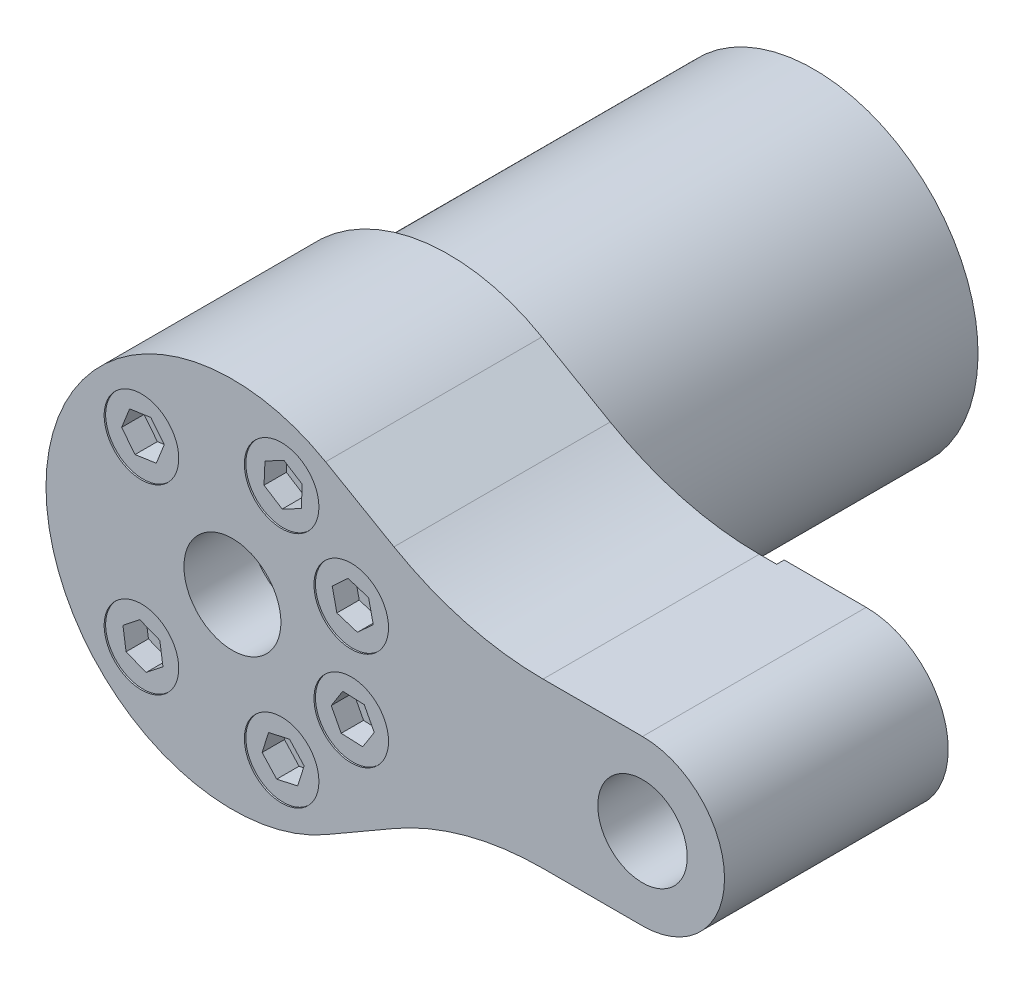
ISO-10303-21;
HEADER;
FILE_DESCRIPTION(('STEP AP214'),'2;1');
FILE_NAME('part.step','',(''),(''),'','','');
FILE_SCHEMA(('AUTOMOTIVE_DESIGN { 1 0 10303 214 1 1 1 1 }'));
ENDSEC;
DATA;
#1=APPLICATION_CONTEXT('core data for automotive mechanical design processes');
#2=APPLICATION_PROTOCOL_DEFINITION('international standard','automotive_design',2000,#1);
#3=PRODUCT_CONTEXT('',#1,'mechanical');
#4=PRODUCT('Part','Part','',(#3));
#5=PRODUCT_RELATED_PRODUCT_CATEGORY('part','',(#4));
#6=PRODUCT_DEFINITION_FORMATION('','',#4);
#7=PRODUCT_DEFINITION_CONTEXT('part definition',#1,'design');
#8=PRODUCT_DEFINITION('design','',#6,#7);
#9=PRODUCT_DEFINITION_SHAPE('','',#8);
#10=(LENGTH_UNIT() NAMED_UNIT(*) SI_UNIT(.MILLI.,.METRE.));
#11=(NAMED_UNIT(*) PLANE_ANGLE_UNIT() SI_UNIT($,.RADIAN.));
#12=(NAMED_UNIT(*) SI_UNIT($,.STERADIAN.) SOLID_ANGLE_UNIT());
#13=UNCERTAINTY_MEASURE_WITH_UNIT(LENGTH_MEASURE(1.E-05),#10,'distance_accuracy_value','');
#14=(GEOMETRIC_REPRESENTATION_CONTEXT(3) GLOBAL_UNCERTAINTY_ASSIGNED_CONTEXT((#13)) GLOBAL_UNIT_ASSIGNED_CONTEXT((#10,
#11,#12)) REPRESENTATION_CONTEXT('',''));
#15=CARTESIAN_POINT('',(0.,0.,0.));
#16=DIRECTION('',(0.,0.,1.));
#17=DIRECTION('',(1.,0.,0.));
#18=AXIS2_PLACEMENT_3D('',#15,#16,#17);
#19=CARTESIAN_POINT('',(-8.977218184,10.145148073,26.8));
#20=DIRECTION('',(0.,0.,1.));
#21=DIRECTION('',(-0.145785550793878,0.989316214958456,0.));
#22=AXIS2_PLACEMENT_3D('',#19,#20,#21);
#23=PLANE('',#22);
#24=DIRECTION('',(0.368404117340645,0.929665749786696,0.));
#25=VECTOR('',#24,1.);
#26=CARTESIAN_POINT('',(-14.5217563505,13.1186022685,26.8));
#27=LINE('',#26,#25);
#28=CARTESIAN_POINT('',(-15.0535018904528,11.7767453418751,26.8));
#29=VERTEX_POINT('',#28);
#30=CARTESIAN_POINT('',(-13.9900108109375,14.460459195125,26.8));
#31=VERTEX_POINT('',#30);
#32=EDGE_CURVE('E506',#29,#31,#27,.T.);
#33=ORIENTED_EDGE('',*,*,#32,.F.);
#34=DIRECTION('',(0.620912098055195,-0.783880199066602,0.));
#35=VECTOR('',#34,1.);
#36=CARTESIAN_POINT('',(-14.1572924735,10.645311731,26.8));
#37=LINE('',#36,#35);
#38=CARTESIAN_POINT('',(-13.261083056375,9.51387812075,26.8));
#39=VERTEX_POINT('',#38);
#40=EDGE_CURVE('E495',#29,#39,#37,.T.);
#41=ORIENTED_EDGE('',*,*,#40,.T.);
#42=DIRECTION('',(0.989316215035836,0.145785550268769,0.));
#43=VECTOR('',#42,1.);
#44=CARTESIAN_POINT('',(-11.8331280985,9.724301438,26.8));
#45=LINE('',#44,#43);
#46=CARTESIAN_POINT('',(-10.405173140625,9.93472475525,26.8));
#47=VERTEX_POINT('',#46);
#48=EDGE_CURVE('E496',#39,#47,#45,.T.);
#49=ORIENTED_EDGE('',*,*,#48,.T.);
#50=DIRECTION('',(-0.368404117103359,-0.929665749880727,0.));
#51=VECTOR('',#50,1.);
#52=CARTESIAN_POINT('',(-9.8734276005,11.2765816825,26.8));
#53=LINE('',#52,#51);
#54=CARTESIAN_POINT('',(-9.34168206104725,12.6184386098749,26.8));
#55=VERTEX_POINT('',#54);
#56=EDGE_CURVE('E215',#55,#47,#53,.T.);
#57=ORIENTED_EDGE('',*,*,#56,.F.);
#58=DIRECTION('',(-0.620912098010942,0.783880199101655,0.));
#59=VECTOR('',#58,1.);
#60=CARTESIAN_POINT('',(-10.237891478,13.7498722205,26.8));
#61=LINE('',#60,#59);
#62=CARTESIAN_POINT('',(-11.134100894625,14.88130583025,26.8));
#63=VERTEX_POINT('',#62);
#64=EDGE_CURVE('E211',#55,#63,#61,.T.);
#65=ORIENTED_EDGE('',*,*,#64,.T.);
#66=DIRECTION('',(-0.989316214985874,-0.145785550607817,0.));
#67=VECTOR('',#66,1.);
#68=CARTESIAN_POINT('',(-12.5620558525,14.6708825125,26.8));
#69=LINE('',#68,#67);
#70=EDGE_CURVE('E643',#63,#31,#69,.T.);
#71=ORIENTED_EDGE('',*,*,#70,.T.);
#72=EDGE_LOOP('',(#33,#41,#49,#57,#65,#71));
#73=FACE_BOUND('',#72,.T.);
#74=ADVANCED_FACE('F14',(#73),#23,.T.);
#75=CARTESIAN_POINT('',(12.119697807,6.491138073,26.8));
#76=DIRECTION('',(0.,0.,1.));
#77=DIRECTION('',(0.676185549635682,-0.736731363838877,0.));
#78=AXIS2_PLACEMENT_3D('',#75,#76,#77);
#79=PLANE('',#78);
#80=DIRECTION('',(0.217228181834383,-0.976120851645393,0.));
#81=VECTOR('',#80,1.);
#82=CARTESIAN_POINT('',(18.377224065,7.1443596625,26.8));
#83=LINE('',#82,#81);
#84=CARTESIAN_POINT('',(18.0636821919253,8.5532687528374,26.8));
#85=VERTEX_POINT('',#84);
#86=CARTESIAN_POINT('',(18.690765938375,5.735450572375,26.8));
#87=VERTEX_POINT('',#86);
#88=EDGE_CURVE('E491',#85,#87,#83,.T.);
#89=ORIENTED_EDGE('',*,*,#88,.F.);
#90=DIRECTION('',(-0.953959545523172,0.299935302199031,0.));
#91=VECTOR('',#90,1.);
#92=CARTESIAN_POINT('',(16.6867601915,8.9861880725,26.8));
#93=LINE('',#92,#91);
#94=CARTESIAN_POINT('',(15.30983819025,9.419107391,26.8));
#95=VERTEX_POINT('',#94);
#96=EDGE_CURVE('E474',#85,#95,#93,.T.);
#97=ORIENTED_EDGE('',*,*,#96,.T.);
#98=DIRECTION('',(-0.736731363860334,-0.676185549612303,0.));
#99=VECTOR('',#98,1.);
#100=CARTESIAN_POINT('',(14.2464580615,8.443117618,26.8));
#101=LINE('',#100,#99);
#102=CARTESIAN_POINT('',(13.18307793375,7.467127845,26.8));
#103=VERTEX_POINT('',#102);
#104=EDGE_CURVE('E475',#95,#103,#101,.T.);
#105=ORIENTED_EDGE('',*,*,#104,.T.);
#106=DIRECTION('',(-0.217228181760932,0.976120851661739,0.));
#107=VECTOR('',#106,1.);
#108=CARTESIAN_POINT('',(13.496619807,6.058218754,26.8));
#109=LINE('',#108,#107);
#110=CARTESIAN_POINT('',(13.8101616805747,4.6493096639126,26.8));
#111=VERTEX_POINT('',#110);
#112=EDGE_CURVE('E479',#111,#103,#109,.T.);
#113=ORIENTED_EDGE('',*,*,#112,.F.);
#114=DIRECTION('',(0.953959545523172,-0.299935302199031,0.));
#115=VECTOR('',#114,1.);
#116=CARTESIAN_POINT('',(15.1870836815,4.2163903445,26.8));
#117=LINE('',#116,#115);
#118=CARTESIAN_POINT('',(16.564005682,3.783471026,26.8));
#119=VERTEX_POINT('',#118);
#120=EDGE_CURVE('E483',#111,#119,#117,.T.);
#121=ORIENTED_EDGE('',*,*,#120,.T.);
#122=DIRECTION('',(0.736731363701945,0.676185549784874,0.));
#123=VECTOR('',#122,1.);
#124=CARTESIAN_POINT('',(17.62738581,4.759460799,26.8));
#125=LINE('',#124,#123);
#126=EDGE_CURVE('E632',#119,#87,#125,.T.);
#127=ORIENTED_EDGE('',*,*,#126,.T.);
#128=EDGE_LOOP('',(#89,#97,#105,#113,#121,#127));
#129=FACE_BOUND('',#128,.T.);
#130=ADVANCED_FACE('F718',(#129),#79,.T.);
#131=CARTESIAN_POINT('',(3.979992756,13.159848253,26.8));
#132=DIRECTION('',(0.,0.,1.));
#133=DIRECTION('',(0.999083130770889,-0.0428123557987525,0.));
#134=AXIS2_PLACEMENT_3D('',#131,#132,#133);
#135=PLANE('',#134);
#136=DIRECTION('',(0.84382519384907,-0.536618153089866,0.));
#137=VECTOR('',#136,1.);
#138=CARTESIAN_POINT('',(7.9428345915,18.0464849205,26.8));
#139=LINE('',#138,#137);
#140=CARTESIAN_POINT('',(6.72487783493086,18.821026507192,26.8));
#141=VERTEX_POINT('',#140);
#142=CARTESIAN_POINT('',(9.1607913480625,17.2719433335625,26.8));
#143=VERTEX_POINT('',#142);
#144=EDGE_CURVE('E467',#141,#143,#139,.T.);
#145=ORIENTED_EDGE('',*,*,#144,.F.);
#146=DIRECTION('',(-0.886637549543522,-0.462464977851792,0.));
#147=VECTOR('',#146,1.);
#148=CARTESIAN_POINT('',(5.4451267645,18.1535158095,26.8));
#149=LINE('',#148,#147);
#150=CARTESIAN_POINT('',(4.165375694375,17.486005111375,26.8));
#151=VERTEX_POINT('',#150);
#152=EDGE_CURVE('E450',#141,#151,#149,.T.);
#153=ORIENTED_EDGE('',*,*,#152,.T.);
#154=DIRECTION('',(-0.0428123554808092,-0.999083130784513,0.));
#155=VECTOR('',#154,1.);
#156=CARTESIAN_POINT('',(4.1035813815,16.0439528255,26.8));
#157=LINE('',#156,#155);
#158=CARTESIAN_POINT('',(4.041787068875,14.601900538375,26.8));
#159=VERTEX_POINT('',#158);
#160=EDGE_CURVE('E451',#151,#159,#157,.T.);
#161=ORIENTED_EDGE('',*,*,#160,.T.);
#162=DIRECTION('',(-0.843825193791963,0.536618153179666,0.));
#163=VECTOR('',#162,1.);
#164=CARTESIAN_POINT('',(5.259743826,13.827358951,26.8));
#165=LINE('',#164,#163);
#166=CARTESIAN_POINT('',(6.47770058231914,13.052817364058,26.8));
#167=VERTEX_POINT('',#166);
#168=EDGE_CURVE('E455',#167,#159,#165,.T.);
#169=ORIENTED_EDGE('',*,*,#168,.F.);
#170=DIRECTION('',(0.886637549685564,0.46246497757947,0.));
#171=VECTOR('',#170,1.);
#172=CARTESIAN_POINT('',(7.7574516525,13.720328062,26.8));
#173=LINE('',#172,#171);
#174=CARTESIAN_POINT('',(9.037202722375,14.387838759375,26.8));
#175=VERTEX_POINT('',#174);
#176=EDGE_CURVE('E459',#167,#175,#173,.T.);
#177=ORIENTED_EDGE('',*,*,#176,.T.);
#178=DIRECTION('',(0.0428123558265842,0.999083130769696,0.));
#179=VECTOR('',#178,1.);
#180=CARTESIAN_POINT('',(9.098997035,15.8298910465,26.8));
#181=LINE('',#180,#179);
#182=EDGE_CURVE('E619',#175,#143,#181,.T.);
#183=ORIENTED_EDGE('',*,*,#182,.T.);
#184=EDGE_LOOP('',(#145,#153,#161,#169,#177,#183));
#185=FACE_BOUND('',#184,.T.);
#186=ADVANCED_FACE('F722',(#185),#135,.T.);
#187=CARTESIAN_POINT('',(-10.145148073,-8.977218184,26.8));
#188=DIRECTION('',(0.,0.,1.));
#189=DIRECTION('',(-0.989316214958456,-0.145785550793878,0.));
#190=AXIS2_PLACEMENT_3D('',#187,#188,#189);
#191=PLANE('',#190);
#192=DIRECTION('',(-0.929665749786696,0.368404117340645,0.));
#193=VECTOR('',#192,1.);
#194=CARTESIAN_POINT('',(-13.1186022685,-14.5217563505,26.8));
#195=LINE('',#194,#193);
#196=CARTESIAN_POINT('',(-11.7767453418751,-15.0535018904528,26.8));
#197=VERTEX_POINT('',#196);
#198=CARTESIAN_POINT('',(-14.460459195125,-13.9900108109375,26.8));
#199=VERTEX_POINT('',#198);
#200=EDGE_CURVE('E443',#197,#199,#195,.T.);
#201=ORIENTED_EDGE('',*,*,#200,.F.);
#202=DIRECTION('',(0.783880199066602,0.620912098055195,0.));
#203=VECTOR('',#202,1.);
#204=CARTESIAN_POINT('',(-10.645311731,-14.1572924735,26.8));
#205=LINE('',#204,#203);
#206=CARTESIAN_POINT('',(-9.51387812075,-13.261083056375,26.8));
#207=VERTEX_POINT('',#206);
#208=EDGE_CURVE('E426',#197,#207,#205,.T.);
#209=ORIENTED_EDGE('',*,*,#208,.T.);
#210=DIRECTION('',(-0.145785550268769,0.989316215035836,0.));
#211=VECTOR('',#210,1.);
#212=CARTESIAN_POINT('',(-9.724301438,-11.8331280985,26.8));
#213=LINE('',#212,#211);
#214=CARTESIAN_POINT('',(-9.93472475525,-10.405173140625,26.8));
#215=VERTEX_POINT('',#214);
#216=EDGE_CURVE('E427',#207,#215,#213,.T.);
#217=ORIENTED_EDGE('',*,*,#216,.T.);
#218=DIRECTION('',(0.929665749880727,-0.368404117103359,0.));
#219=VECTOR('',#218,1.);
#220=CARTESIAN_POINT('',(-11.2765816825,-9.8734276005,26.8));
#221=LINE('',#220,#219);
#222=CARTESIAN_POINT('',(-12.6184386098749,-9.34168206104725,26.8));
#223=VERTEX_POINT('',#222);
#224=EDGE_CURVE('E431',#223,#215,#221,.T.);
#225=ORIENTED_EDGE('',*,*,#224,.F.);
#226=DIRECTION('',(-0.783880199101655,-0.620912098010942,0.));
#227=VECTOR('',#226,1.);
#228=CARTESIAN_POINT('',(-13.7498722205,-10.237891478,26.8));
#229=LINE('',#228,#227);
#230=CARTESIAN_POINT('',(-14.88130583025,-11.134100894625,26.8));
#231=VERTEX_POINT('',#230);
#232=EDGE_CURVE('E435',#223,#231,#229,.T.);
#233=ORIENTED_EDGE('',*,*,#232,.T.);
#234=DIRECTION('',(0.145785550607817,-0.989316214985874,0.));
#235=VECTOR('',#234,1.);
#236=CARTESIAN_POINT('',(-14.6708825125,-12.5620558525,26.8));
#237=LINE('',#236,#235);
#238=EDGE_CURVE('E606',#231,#199,#237,.T.);
#239=ORIENTED_EDGE('',*,*,#238,.T.);
#240=EDGE_LOOP('',(#201,#209,#217,#225,#233,#239));
#241=FACE_BOUND('',#240,.T.);
#242=ADVANCED_FACE('F726',(#241),#191,.T.);
#243=CARTESIAN_POINT('',(13.159848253,-3.979992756,26.8));
#244=DIRECTION('',(0.,0.,1.));
#245=DIRECTION('',(-0.0428123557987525,-0.999083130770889,0.));
#246=AXIS2_PLACEMENT_3D('',#243,#244,#245);
#247=PLANE('',#246);
#248=DIRECTION('',(-0.536618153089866,-0.84382519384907,0.));
#249=VECTOR('',#248,1.);
#250=CARTESIAN_POINT('',(18.0464849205,-7.9428345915,26.8));
#251=LINE('',#250,#249);
#252=CARTESIAN_POINT('',(18.821026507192,-6.72487783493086,26.8));
#253=VERTEX_POINT('',#252);
#254=CARTESIAN_POINT('',(17.2719433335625,-9.1607913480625,26.8));
#255=VERTEX_POINT('',#254);
#256=EDGE_CURVE('E419',#253,#255,#251,.T.);
#257=ORIENTED_EDGE('',*,*,#256,.F.);
#258=DIRECTION('',(-0.462464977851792,0.886637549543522,0.));
#259=VECTOR('',#258,1.);
#260=CARTESIAN_POINT('',(18.1535158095,-5.4451267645,26.8));
#261=LINE('',#260,#259);
#262=CARTESIAN_POINT('',(17.486005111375,-4.165375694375,26.8));
#263=VERTEX_POINT('',#262);
#264=EDGE_CURVE('E402',#253,#263,#261,.T.);
#265=ORIENTED_EDGE('',*,*,#264,.T.);
#266=DIRECTION('',(-0.999083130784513,0.0428123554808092,0.));
#267=VECTOR('',#266,1.);
#268=CARTESIAN_POINT('',(16.0439528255,-4.1035813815,26.8));
#269=LINE('',#268,#267);
#270=CARTESIAN_POINT('',(14.601900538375,-4.041787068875,26.8));
#271=VERTEX_POINT('',#270);
#272=EDGE_CURVE('E403',#263,#271,#269,.T.);
#273=ORIENTED_EDGE('',*,*,#272,.T.);
#274=DIRECTION('',(0.536618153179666,0.843825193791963,0.));
#275=VECTOR('',#274,1.);
#276=CARTESIAN_POINT('',(13.827358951,-5.259743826,26.8));
#277=LINE('',#276,#275);
#278=CARTESIAN_POINT('',(13.052817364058,-6.47770058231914,26.8));
#279=VERTEX_POINT('',#278);
#280=EDGE_CURVE('E407',#279,#271,#277,.T.);
#281=ORIENTED_EDGE('',*,*,#280,.F.);
#282=DIRECTION('',(0.46246497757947,-0.886637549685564,0.));
#283=VECTOR('',#282,1.);
#284=CARTESIAN_POINT('',(13.720328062,-7.7574516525,26.8));
#285=LINE('',#284,#283);
#286=CARTESIAN_POINT('',(14.387838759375,-9.037202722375,26.8));
#287=VERTEX_POINT('',#286);
#288=EDGE_CURVE('E411',#279,#287,#285,.T.);
#289=ORIENTED_EDGE('',*,*,#288,.T.);
#290=DIRECTION('',(0.999083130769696,-0.0428123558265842,0.));
#291=VECTOR('',#290,1.);
#292=CARTESIAN_POINT('',(15.8298910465,-9.098997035,26.8));
#293=LINE('',#292,#291);
#294=EDGE_CURVE('E593',#287,#255,#293,.T.);
#295=ORIENTED_EDGE('',*,*,#294,.T.);
#296=EDGE_LOOP('',(#257,#265,#273,#281,#289,#295));
#297=FACE_BOUND('',#296,.T.);
#298=ADVANCED_FACE('F730',(#297),#247,.T.);
#299=CARTESIAN_POINT('',(6.491138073,-12.119697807,26.8));
#300=DIRECTION('',(0.,0.,1.));
#301=DIRECTION('',(-0.736731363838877,-0.676185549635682,0.));
#302=AXIS2_PLACEMENT_3D('',#299,#300,#301);
#303=PLANE('',#302);
#304=DIRECTION('',(-0.976120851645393,-0.217228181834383,0.));
#305=VECTOR('',#304,1.);
#306=CARTESIAN_POINT('',(7.1443596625,-18.377224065,26.8));
#307=LINE('',#306,#305);
#308=CARTESIAN_POINT('',(8.5532687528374,-18.0636821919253,26.8));
#309=VERTEX_POINT('',#308);
#310=CARTESIAN_POINT('',(5.735450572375,-18.690765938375,26.8));
#311=VERTEX_POINT('',#310);
#312=EDGE_CURVE('E395',#309,#311,#307,.T.);
#313=ORIENTED_EDGE('',*,*,#312,.F.);
#314=DIRECTION('',(0.299935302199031,0.953959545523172,0.));
#315=VECTOR('',#314,1.);
#316=CARTESIAN_POINT('',(8.9861880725,-16.6867601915,26.8));
#317=LINE('',#316,#315);
#318=CARTESIAN_POINT('',(9.419107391,-15.30983819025,26.8));
#319=VERTEX_POINT('',#318);
#320=EDGE_CURVE('E378',#309,#319,#317,.T.);
#321=ORIENTED_EDGE('',*,*,#320,.T.);
#322=DIRECTION('',(-0.676185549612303,0.736731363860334,0.));
#323=VECTOR('',#322,1.);
#324=CARTESIAN_POINT('',(8.443117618,-14.2464580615,26.8));
#325=LINE('',#324,#323);
#326=CARTESIAN_POINT('',(7.467127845,-13.18307793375,26.8));
#327=VERTEX_POINT('',#326);
#328=EDGE_CURVE('E379',#319,#327,#325,.T.);
#329=ORIENTED_EDGE('',*,*,#328,.T.);
#330=DIRECTION('',(0.976120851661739,0.217228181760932,0.));
#331=VECTOR('',#330,1.);
#332=CARTESIAN_POINT('',(6.058218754,-13.496619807,26.8));
#333=LINE('',#332,#331);
#334=CARTESIAN_POINT('',(4.6493096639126,-13.8101616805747,26.8));
#335=VERTEX_POINT('',#334);
#336=EDGE_CURVE('E383',#335,#327,#333,.T.);
#337=ORIENTED_EDGE('',*,*,#336,.F.);
#338=DIRECTION('',(-0.299935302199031,-0.953959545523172,0.));
#339=VECTOR('',#338,1.);
#340=CARTESIAN_POINT('',(4.2163903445,-15.1870836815,26.8));
#341=LINE('',#340,#339);
#342=CARTESIAN_POINT('',(3.783471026,-16.564005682,26.8));
#343=VERTEX_POINT('',#342);
#344=EDGE_CURVE('E387',#335,#343,#341,.T.);
#345=ORIENTED_EDGE('',*,*,#344,.T.);
#346=DIRECTION('',(0.676185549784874,-0.736731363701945,0.));
#347=VECTOR('',#346,1.);
#348=CARTESIAN_POINT('',(4.759460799,-17.62738581,26.8));
#349=LINE('',#348,#347);
#350=EDGE_CURVE('E580',#343,#311,#349,.T.);
#351=ORIENTED_EDGE('',*,*,#350,.T.);
#352=EDGE_LOOP('',(#313,#321,#329,#337,#345,#351));
#353=FACE_BOUND('',#352,.T.);
#354=ADVANCED_FACE('F734',(#353),#303,.T.);
#355=CARTESIAN_POINT('',(-11.134100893,14.88130583,26.8));
#356=DIRECTION('',(-0.145785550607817,0.989316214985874,0.));
#357=DIRECTION('',(-0.989316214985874,-0.145785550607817,0.));
#358=AXIS2_PLACEMENT_3D('',#355,#356,#357);
#359=PLANE('',#358);
#360=ORIENTED_EDGE('',*,*,#70,.F.);
#361=DIRECTION('',(0.,0.,1.));
#362=VECTOR('',#361,1.);
#363=CARTESIAN_POINT('',(-11.134100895,14.88130583,28.3));
#364=LINE('',#363,#362);
#365=CARTESIAN_POINT('',(-11.1341008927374,14.8813058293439,29.8));
#366=VERTEX_POINT('',#365);
#367=EDGE_CURVE('E216',#63,#366,#364,.T.);
#368=ORIENTED_EDGE('',*,*,#367,.T.);
#369=DIRECTION('',(0.989316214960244,0.145785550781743,0.));
#370=VECTOR('',#369,1.);
#371=CARTESIAN_POINT('',(-12.5620558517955,14.6708825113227,29.8));
#372=LINE('',#371,#370);
#373=CARTESIAN_POINT('',(-13.9900108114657,14.4604591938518,29.8));
#374=VERTEX_POINT('',#373);
#375=EDGE_CURVE('E193',#374,#366,#372,.T.);
#376=ORIENTED_EDGE('',*,*,#375,.F.);
#377=DIRECTION('',(0.,0.,1.));
#378=VECTOR('',#377,1.);
#379=CARTESIAN_POINT('',(-13.99001081,14.460459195,28.3));
#380=LINE('',#379,#378);
#381=EDGE_CURVE('E500',#31,#374,#380,.T.);
#382=ORIENTED_EDGE('',*,*,#381,.F.);
#383=EDGE_LOOP('',(#360,#368,#376,#382));
#384=FACE_BOUND('',#383,.T.);
#385=ADVANCED_FACE('F738',(#384),#359,.F.);
#386=CARTESIAN_POINT('',(-9.341682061,12.618438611,26.8));
#387=DIRECTION('',(0.783880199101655,0.620912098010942,0.));
#388=DIRECTION('',(-0.620912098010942,0.783880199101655,0.));
#389=AXIS2_PLACEMENT_3D('',#386,#387,#388);
#390=PLANE('',#389);
#391=ORIENTED_EDGE('',*,*,#64,.F.);
#392=DIRECTION('',(0.,0.,-1.));
#393=VECTOR('',#392,1.);
#394=CARTESIAN_POINT('',(-9.34168206,12.61843861,28.3));
#395=LINE('',#394,#393);
#396=CARTESIAN_POINT('',(-9.34168206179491,12.618438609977,29.8));
#397=VERTEX_POINT('',#396);
#398=EDGE_CURVE('E207',#397,#55,#395,.T.);
#399=ORIENTED_EDGE('',*,*,#398,.F.);
#400=DIRECTION('',(0.620912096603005,-0.783880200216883,0.));
#401=VECTOR('',#400,1.);
#402=CARTESIAN_POINT('',(-11.13410089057,14.8813058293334,29.8));
#403=LINE('',#402,#401);
#404=EDGE_CURVE('E196',#366,#397,#403,.T.);
#405=ORIENTED_EDGE('',*,*,#404,.F.);
#406=ORIENTED_EDGE('',*,*,#367,.F.);
#407=EDGE_LOOP('',(#391,#399,#405,#406));
#408=FACE_BOUND('',#407,.T.);
#409=ADVANCED_FACE('F208',(#408),#390,.F.);
#410=CARTESIAN_POINT('',(-9.34168206,12.61843861,26.8));
#411=DIRECTION('',(-0.929665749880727,0.368404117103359,0.));
#412=DIRECTION('',(-0.368404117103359,-0.929665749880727,0.));
#413=AXIS2_PLACEMENT_3D('',#410,#411,#412);
#414=PLANE('',#413);
#415=ORIENTED_EDGE('',*,*,#398,.T.);
#416=ORIENTED_EDGE('',*,*,#56,.T.);
#417=DIRECTION('',(0.,0.,1.));
#418=VECTOR('',#417,1.);
#419=CARTESIAN_POINT('',(-10.405173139,9.934724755,28.3));
#420=LINE('',#419,#418);
#421=CARTESIAN_POINT('',(-10.4051731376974,9.93472475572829,29.8));
#422=VERTEX_POINT('',#421);
#423=EDGE_CURVE('E220',#47,#422,#420,.T.);
#424=ORIENTED_EDGE('',*,*,#423,.T.);
#425=DIRECTION('',(-0.368404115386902,-0.929665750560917,0.));
#426=VECTOR('',#425,1.);
#427=CARTESIAN_POINT('',(-9.34168206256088,12.6184386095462,29.8));
#428=LINE('',#427,#426);
#429=EDGE_CURVE('E201',#397,#422,#428,.T.);
#430=ORIENTED_EDGE('',*,*,#429,.F.);
#431=EDGE_LOOP('',(#415,#416,#424,#430));
#432=FACE_BOUND('',#431,.T.);
#433=ADVANCED_FACE('F218',(#432),#414,.T.);
#434=CARTESIAN_POINT('',(-13.261083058,9.513878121,26.8));
#435=DIRECTION('',(0.145785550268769,-0.989316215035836,0.));
#436=DIRECTION('',(0.989316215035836,0.145785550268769,0.));
#437=AXIS2_PLACEMENT_3D('',#434,#435,#436);
#438=PLANE('',#437);
#439=ORIENTED_EDGE('',*,*,#48,.F.);
#440=DIRECTION('',(0.,0.,1.));
#441=VECTOR('',#440,1.);
#442=CARTESIAN_POINT('',(-13.261083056,9.513878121,28.3));
#443=LINE('',#442,#441);
#444=CARTESIAN_POINT('',(-13.2610830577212,9.51387812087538,29.8));
#445=VERTEX_POINT('',#444);
#446=EDGE_CURVE('E503',#39,#445,#443,.T.);
#447=ORIENTED_EDGE('',*,*,#446,.T.);
#448=DIRECTION('',(-0.989316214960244,-0.145785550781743,0.));
#449=VECTOR('',#448,1.);
#450=CARTESIAN_POINT('',(-11.8331280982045,9.72430143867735,29.8));
#451=LINE('',#450,#449);
#452=EDGE_CURVE('E222',#422,#445,#451,.T.);
#453=ORIENTED_EDGE('',*,*,#452,.F.);
#454=ORIENTED_EDGE('',*,*,#423,.F.);
#455=EDGE_LOOP('',(#439,#447,#453,#454));
#456=FACE_BOUND('',#455,.T.);
#457=ADVANCED_FACE('F747',(#456),#438,.F.);
#458=CARTESIAN_POINT('',(-15.053501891,11.776745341,26.8));
#459=DIRECTION('',(-0.783880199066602,-0.620912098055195,0.));
#460=DIRECTION('',(0.620912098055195,-0.783880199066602,0.));
#461=AXIS2_PLACEMENT_3D('',#458,#459,#460);
#462=PLANE('',#461);
#463=ORIENTED_EDGE('',*,*,#446,.F.);
#464=ORIENTED_EDGE('',*,*,#40,.F.);
#465=DIRECTION('',(0.,0.,-1.));
#466=VECTOR('',#465,1.);
#467=CARTESIAN_POINT('',(-15.053501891,11.776745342,28.3));
#468=LINE('',#467,#466);
#469=CARTESIAN_POINT('',(-15.0535018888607,11.7767453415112,29.8));
#470=VERTEX_POINT('',#469);
#471=EDGE_CURVE('E502',#470,#29,#468,.T.);
#472=ORIENTED_EDGE('',*,*,#471,.F.);
#473=DIRECTION('',(-0.620912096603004,0.783880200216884,0.));
#474=VECTOR('',#473,1.);
#475=CARTESIAN_POINT('',(-13.26108305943,9.51387812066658,29.8));
#476=LINE('',#475,#474);
#477=EDGE_CURVE('E224',#445,#470,#476,.T.);
#478=ORIENTED_EDGE('',*,*,#477,.F.);
#479=EDGE_LOOP('',(#463,#464,#472,#478));
#480=FACE_BOUND('',#479,.T.);
#481=ADVANCED_FACE('F750',(#480),#462,.F.);
#482=CARTESIAN_POINT('',(-15.053501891,11.776745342,26.8));
#483=DIRECTION('',(0.929665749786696,-0.368404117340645,0.));
#484=DIRECTION('',(0.368404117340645,0.929665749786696,0.));
#485=AXIS2_PLACEMENT_3D('',#482,#483,#484);
#486=PLANE('',#485);
#487=ORIENTED_EDGE('',*,*,#471,.T.);
#488=ORIENTED_EDGE('',*,*,#32,.T.);
#489=ORIENTED_EDGE('',*,*,#381,.T.);
#490=DIRECTION('',(0.368404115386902,0.929665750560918,0.));
#491=VECTOR('',#490,1.);
#492=CARTESIAN_POINT('',(-15.0535018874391,11.7767453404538,29.8));
#493=LINE('',#492,#491);
#494=EDGE_CURVE('E228',#470,#374,#493,.T.);
#495=ORIENTED_EDGE('',*,*,#494,.F.);
#496=EDGE_LOOP('',(#487,#488,#489,#495));
#497=FACE_BOUND('',#496,.T.);
#498=ADVANCED_FACE('F754',(#497),#486,.T.);
#499=CARTESIAN_POINT('',(16.564005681,3.783471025,26.8));
#500=DIRECTION('',(0.676185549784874,-0.736731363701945,0.));
#501=DIRECTION('',(0.736731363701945,0.676185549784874,0.));
#502=AXIS2_PLACEMENT_3D('',#499,#500,#501);
#503=PLANE('',#502);
#504=ORIENTED_EDGE('',*,*,#126,.F.);
#505=DIRECTION('',(0.,0.,1.));
#506=VECTOR('',#505,1.);
#507=CARTESIAN_POINT('',(16.564005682,3.783471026,28.3));
#508=LINE('',#507,#506);
#509=CARTESIAN_POINT('',(16.5640056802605,3.78347102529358,29.8));
#510=VERTEX_POINT('',#509);
#511=EDGE_CURVE('E480',#119,#510,#508,.T.);
#512=ORIENTED_EDGE('',*,*,#511,.T.);
#513=DIRECTION('',(-0.736731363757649,-0.676185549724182,0.));
#514=VECTOR('',#513,1.);
#515=CARTESIAN_POINT('',(17.6273858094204,4.7594607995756,29.8));
#516=LINE('',#515,#514);
#517=CARTESIAN_POINT('',(18.690765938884,5.7354505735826,29.8));
#518=VERTEX_POINT('',#517);
#519=EDGE_CURVE('E230',#518,#510,#516,.T.);
#520=ORIENTED_EDGE('',*,*,#519,.F.);
#521=DIRECTION('',(0.,0.,1.));
#522=VECTOR('',#521,1.);
#523=CARTESIAN_POINT('',(18.690765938,5.735450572,28.3));
#524=LINE('',#523,#522);
#525=EDGE_CURVE('E485',#87,#518,#524,.T.);
#526=ORIENTED_EDGE('',*,*,#525,.F.);
#527=EDGE_LOOP('',(#504,#512,#520,#526));
#528=FACE_BOUND('',#527,.T.);
#529=ADVANCED_FACE('F758',(#528),#503,.F.);
#530=CARTESIAN_POINT('',(13.810161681,4.649309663,26.8));
#531=DIRECTION('',(-0.299935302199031,-0.953959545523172,0.));
#532=DIRECTION('',(0.953959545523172,-0.299935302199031,0.));
#533=AXIS2_PLACEMENT_3D('',#530,#531,#532);
#534=PLANE('',#533);
#535=ORIENTED_EDGE('',*,*,#120,.F.);
#536=DIRECTION('',(0.,0.,-1.));
#537=VECTOR('',#536,1.);
#538=CARTESIAN_POINT('',(13.81016168,4.649309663,28.3));
#539=LINE('',#538,#537);
#540=CARTESIAN_POINT('',(13.8101616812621,4.64930966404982,29.8));
#541=VERTEX_POINT('',#540);
#542=EDGE_CURVE('E476',#541,#111,#539,.T.);
#543=ORIENTED_EDGE('',*,*,#542,.F.);
#544=DIRECTION('',(-0.953959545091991,0.299935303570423,0.));
#545=VECTOR('',#544,1.);
#546=CARTESIAN_POINT('',(16.5640056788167,3.78347102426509,29.8));
#547=LINE('',#546,#545);
#548=EDGE_CURVE('E231',#510,#541,#547,.T.);
#549=ORIENTED_EDGE('',*,*,#548,.F.);
#550=ORIENTED_EDGE('',*,*,#511,.F.);
#551=EDGE_LOOP('',(#535,#543,#549,#550));
#552=FACE_BOUND('',#551,.T.);
#553=ADVANCED_FACE('F762',(#552),#534,.F.);
#554=CARTESIAN_POINT('',(13.81016168,4.649309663,26.8));
#555=DIRECTION('',(0.976120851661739,0.217228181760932,0.));
#556=DIRECTION('',(-0.217228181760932,0.976120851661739,0.));
#557=AXIS2_PLACEMENT_3D('',#554,#555,#556);
#558=PLANE('',#557);
#559=ORIENTED_EDGE('',*,*,#542,.T.);
#560=ORIENTED_EDGE('',*,*,#112,.T.);
#561=DIRECTION('',(0.,0.,1.));
#562=VECTOR('',#561,1.);
#563=CARTESIAN_POINT('',(13.183077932,7.467127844,28.3));
#564=LINE('',#563,#562);
#565=CARTESIAN_POINT('',(13.1830779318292,7.46712784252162,29.8));
#566=VERTEX_POINT('',#565);
#567=EDGE_CURVE('E471',#103,#566,#564,.T.);
#568=ORIENTED_EDGE('',*,*,#567,.T.);
#569=DIRECTION('',(-0.217228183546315,0.976120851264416,0.));
#570=VECTOR('',#569,1.);
#571=CARTESIAN_POINT('',(13.8101616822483,4.64930966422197,29.8));
#572=LINE('',#571,#570);
#573=EDGE_CURVE('E233',#541,#566,#572,.T.);
#574=ORIENTED_EDGE('',*,*,#573,.F.);
#575=EDGE_LOOP('',(#559,#560,#568,#574));
#576=FACE_BOUND('',#575,.T.);
#577=ADVANCED_FACE('F766',(#576),#558,.T.);
#578=CARTESIAN_POINT('',(15.309838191,9.419107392,26.8));
#579=DIRECTION('',(-0.676185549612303,0.736731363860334,0.));
#580=DIRECTION('',(-0.736731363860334,-0.676185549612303,0.));
#581=AXIS2_PLACEMENT_3D('',#578,#579,#580);
#582=PLANE('',#581);
#583=ORIENTED_EDGE('',*,*,#104,.F.);
#584=DIRECTION('',(0.,0.,1.));
#585=VECTOR('',#584,1.);
#586=CARTESIAN_POINT('',(15.309838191,9.419107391,28.3));
#587=LINE('',#586,#585);
#588=CARTESIAN_POINT('',(15.3098381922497,9.41910739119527,29.8));
#589=VERTEX_POINT('',#588);
#590=EDGE_CURVE('E488',#95,#589,#587,.T.);
#591=ORIENTED_EDGE('',*,*,#590,.T.);
#592=DIRECTION('',(0.73673136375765,0.676185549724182,0.));
#593=VECTOR('',#592,1.);
#594=CARTESIAN_POINT('',(14.2464580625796,8.4431176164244,29.8));
#595=LINE('',#594,#593);
#596=EDGE_CURVE('E235',#566,#589,#595,.T.);
#597=ORIENTED_EDGE('',*,*,#596,.F.);
#598=ORIENTED_EDGE('',*,*,#567,.F.);
#599=EDGE_LOOP('',(#583,#591,#597,#598));
#600=FACE_BOUND('',#599,.T.);
#601=ADVANCED_FACE('F770',(#600),#582,.F.);
#602=CARTESIAN_POINT('',(18.063682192,8.553268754,26.8));
#603=DIRECTION('',(0.299935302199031,0.953959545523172,0.));
#604=DIRECTION('',(-0.953959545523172,0.299935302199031,0.));
#605=AXIS2_PLACEMENT_3D('',#602,#603,#604);
#606=PLANE('',#605);
#607=ORIENTED_EDGE('',*,*,#590,.F.);
#608=ORIENTED_EDGE('',*,*,#96,.F.);
#609=DIRECTION('',(0.,0.,-1.));
#610=VECTOR('',#609,1.);
#611=CARTESIAN_POINT('',(18.063682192,8.553268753,28.3));
#612=LINE('',#611,#610);
#613=CARTESIAN_POINT('',(18.0636821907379,8.55326875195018,29.8));
#614=VERTEX_POINT('',#613);
#615=EDGE_CURVE('E487',#614,#85,#612,.T.);
#616=ORIENTED_EDGE('',*,*,#615,.F.);
#617=DIRECTION('',(0.953959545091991,-0.299935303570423,0.));
#618=VECTOR('',#617,1.);
#619=CARTESIAN_POINT('',(15.3098381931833,9.41910739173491,29.8));
#620=LINE('',#619,#618);
#621=EDGE_CURVE('E236',#589,#614,#620,.T.);
#622=ORIENTED_EDGE('',*,*,#621,.F.);
#623=EDGE_LOOP('',(#607,#608,#616,#622));
#624=FACE_BOUND('',#623,.T.);
#625=ADVANCED_FACE('F774',(#624),#606,.F.);
#626=CARTESIAN_POINT('',(18.063682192,8.553268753,26.8));
#627=DIRECTION('',(-0.976120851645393,-0.217228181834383,0.));
#628=DIRECTION('',(0.217228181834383,-0.976120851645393,0.));
#629=AXIS2_PLACEMENT_3D('',#626,#627,#628);
#630=PLANE('',#629);
#631=ORIENTED_EDGE('',*,*,#615,.T.);
#632=ORIENTED_EDGE('',*,*,#88,.T.);
#633=ORIENTED_EDGE('',*,*,#525,.T.);
#634=DIRECTION('',(0.217228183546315,-0.976120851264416,0.));
#635=VECTOR('',#634,1.);
#636=CARTESIAN_POINT('',(18.0636821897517,8.55326875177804,29.8));
#637=LINE('',#636,#635);
#638=EDGE_CURVE('E238',#614,#518,#637,.T.);
#639=ORIENTED_EDGE('',*,*,#638,.F.);
#640=EDGE_LOOP('',(#631,#632,#633,#639));
#641=FACE_BOUND('',#640,.T.);
#642=ADVANCED_FACE('F778',(#641),#630,.T.);
#643=CARTESIAN_POINT('',(9.037202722,14.387838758,26.8));
#644=DIRECTION('',(0.999083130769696,-0.0428123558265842,0.));
#645=DIRECTION('',(0.0428123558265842,0.999083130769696,0.));
#646=AXIS2_PLACEMENT_3D('',#643,#644,#645);
#647=PLANE('',#646);
#648=ORIENTED_EDGE('',*,*,#182,.F.);
#649=DIRECTION('',(0.,0.,1.));
#650=VECTOR('',#649,1.);
#651=CARTESIAN_POINT('',(9.037202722,14.38783876,28.3));
#652=LINE('',#651,#650);
#653=CARTESIAN_POINT('',(9.03720272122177,14.3878387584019,29.8));
#654=VERTEX_POINT('',#653);
#655=EDGE_CURVE('E456',#175,#654,#652,.T.);
#656=ORIENTED_EDGE('',*,*,#655,.T.);
#657=DIRECTION('',(-0.0428123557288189,-0.999083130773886,0.));
#658=VECTOR('',#657,1.);
#659=CARTESIAN_POINT('',(9.09899703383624,15.829891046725,29.8));
#660=LINE('',#659,#658);
#661=CARTESIAN_POINT('',(9.16079134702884,17.2719433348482,29.8));
#662=VERTEX_POINT('',#661);
#663=EDGE_CURVE('E241',#662,#654,#660,.T.);
#664=ORIENTED_EDGE('',*,*,#663,.F.);
#665=DIRECTION('',(0.,0.,1.));
#666=VECTOR('',#665,1.);
#667=CARTESIAN_POINT('',(9.160791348,17.271943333,28.3));
#668=LINE('',#667,#666);
#669=EDGE_CURVE('E461',#143,#662,#668,.T.);
#670=ORIENTED_EDGE('',*,*,#669,.F.);
#671=EDGE_LOOP('',(#648,#656,#664,#670));
#672=FACE_BOUND('',#671,.T.);
#673=ADVANCED_FACE('F782',(#672),#647,.F.);
#674=CARTESIAN_POINT('',(6.477700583,13.052817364,26.8));
#675=DIRECTION('',(0.46246497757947,-0.886637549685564,0.));
#676=DIRECTION('',(0.886637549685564,0.46246497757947,0.));
#677=AXIS2_PLACEMENT_3D('',#674,#675,#676);
#678=PLANE('',#677);
#679=ORIENTED_EDGE('',*,*,#176,.F.);
#680=DIRECTION('',(0.,0.,-1.));
#681=VECTOR('',#680,1.);
#682=CARTESIAN_POINT('',(6.477700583,13.052817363,28.3));
#683=LINE('',#682,#681);
#684=CARTESIAN_POINT('',(6.47770058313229,13.0528173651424,29.8));
#685=VERTEX_POINT('',#684);
#686=EDGE_CURVE('E452',#685,#167,#683,.T.);
#687=ORIENTED_EDGE('',*,*,#686,.F.);
#688=DIRECTION('',(-0.886637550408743,-0.462464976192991,0.));
#689=VECTOR('',#688,1.);
#690=CARTESIAN_POINT('',(9.03720272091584,14.3878387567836,29.8));
#691=LINE('',#690,#689);
#692=EDGE_CURVE('E242',#654,#685,#691,.T.);
#693=ORIENTED_EDGE('',*,*,#692,.F.);
#694=ORIENTED_EDGE('',*,*,#655,.F.);
#695=EDGE_LOOP('',(#679,#687,#693,#694));
#696=FACE_BOUND('',#695,.T.);
#697=ADVANCED_FACE('F786',(#696),#678,.F.);
#698=CARTESIAN_POINT('',(6.477700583,13.052817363,26.8));
#699=DIRECTION('',(0.536618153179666,0.843825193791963,0.));
#700=DIRECTION('',(-0.843825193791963,0.536618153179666,0.));
#701=AXIS2_PLACEMENT_3D('',#698,#699,#700);
#702=PLANE('',#701);
#703=ORIENTED_EDGE('',*,*,#686,.T.);
#704=ORIENTED_EDGE('',*,*,#168,.T.);
#705=DIRECTION('',(0.,0.,1.));
#706=VECTOR('',#705,1.);
#707=CARTESIAN_POINT('',(4.041787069,14.601900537,28.3));
#708=LINE('',#707,#706);
#709=CARTESIAN_POINT('',(4.04178706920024,14.6019005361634,29.8));
#710=VERTEX_POINT('',#709);
#711=EDGE_CURVE('E447',#159,#710,#708,.T.);
#712=ORIENTED_EDGE('',*,*,#711,.T.);
#713=DIRECTION('',(-0.843825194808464,0.536618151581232,0.));
#714=VECTOR('',#713,1.);
#715=CARTESIAN_POINT('',(6.47770058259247,13.0528173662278,29.8));
#716=LINE('',#715,#714);
#717=EDGE_CURVE('E244',#685,#710,#716,.T.);
#718=ORIENTED_EDGE('',*,*,#717,.F.);
#719=EDGE_LOOP('',(#703,#704,#712,#718));
#720=FACE_BOUND('',#719,.T.);
#721=ADVANCED_FACE('F790',(#720),#702,.T.);
#722=CARTESIAN_POINT('',(4.165375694,17.486005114,26.8));
#723=DIRECTION('',(-0.999083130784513,0.0428123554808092,0.));
#724=DIRECTION('',(-0.0428123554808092,-0.999083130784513,0.));
#725=AXIS2_PLACEMENT_3D('',#722,#723,#724);
#726=PLANE('',#725);
#727=ORIENTED_EDGE('',*,*,#160,.F.);
#728=DIRECTION('',(0.,0.,1.));
#729=VECTOR('',#728,1.);
#730=CARTESIAN_POINT('',(4.165375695,17.486005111,28.3));
#731=LINE('',#730,#729);
#732=CARTESIAN_POINT('',(4.16537569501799,17.4860051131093,29.8));
#733=VERTEX_POINT('',#732);
#734=EDGE_CURVE('E464',#151,#733,#731,.T.);
#735=ORIENTED_EDGE('',*,*,#734,.T.);
#736=DIRECTION('',(0.042812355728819,0.999083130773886,0.));
#737=VECTOR('',#736,1.);
#738=CARTESIAN_POINT('',(4.10358138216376,16.0439528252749,29.8));
#739=LINE('',#738,#737);
#740=EDGE_CURVE('E246',#710,#733,#739,.T.);
#741=ORIENTED_EDGE('',*,*,#740,.F.);
#742=ORIENTED_EDGE('',*,*,#711,.F.);
#743=EDGE_LOOP('',(#727,#735,#741,#742));
#744=FACE_BOUND('',#743,.T.);
#745=ADVANCED_FACE('F794',(#744),#726,.F.);
#746=CARTESIAN_POINT('',(6.724877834,18.821026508,26.8));
#747=DIRECTION('',(-0.462464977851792,0.886637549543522,0.));
#748=DIRECTION('',(-0.886637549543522,-0.462464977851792,0.));
#749=AXIS2_PLACEMENT_3D('',#746,#747,#748);
#750=PLANE('',#749);
#751=ORIENTED_EDGE('',*,*,#734,.F.);
#752=ORIENTED_EDGE('',*,*,#152,.F.);
#753=DIRECTION('',(0.,0.,-1.));
#754=VECTOR('',#753,1.);
#755=CARTESIAN_POINT('',(6.724877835,18.821026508,28.3));
#756=LINE('',#755,#754);
#757=CARTESIAN_POINT('',(6.72487783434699,18.8210265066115,29.8));
#758=VERTEX_POINT('',#757);
#759=EDGE_CURVE('E463',#758,#141,#756,.T.);
#760=ORIENTED_EDGE('',*,*,#759,.F.);
#761=DIRECTION('',(0.886637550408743,0.462464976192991,0.));
#762=VECTOR('',#761,1.);
#763=CARTESIAN_POINT('',(4.16537569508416,17.4860051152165,29.8));
#764=LINE('',#763,#762);
#765=EDGE_CURVE('E247',#733,#758,#764,.T.);
#766=ORIENTED_EDGE('',*,*,#765,.F.);
#767=EDGE_LOOP('',(#751,#752,#760,#766));
#768=FACE_BOUND('',#767,.T.);
#769=ADVANCED_FACE('F798',(#768),#750,.F.);
#770=CARTESIAN_POINT('',(6.724877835,18.821026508,26.8));
#771=DIRECTION('',(-0.536618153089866,-0.84382519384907,0.));
#772=DIRECTION('',(0.84382519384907,-0.536618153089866,0.));
#773=AXIS2_PLACEMENT_3D('',#770,#771,#772);
#774=PLANE('',#773);
#775=ORIENTED_EDGE('',*,*,#759,.T.);
#776=ORIENTED_EDGE('',*,*,#144,.T.);
#777=ORIENTED_EDGE('',*,*,#669,.T.);
#778=DIRECTION('',(0.843825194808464,-0.536618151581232,0.));
#779=VECTOR('',#778,1.);
#780=CARTESIAN_POINT('',(6.72487783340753,18.8210265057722,29.8));
#781=LINE('',#780,#779);
#782=EDGE_CURVE('E249',#758,#662,#781,.T.);
#783=ORIENTED_EDGE('',*,*,#782,.F.);
#784=EDGE_LOOP('',(#775,#776,#777,#783));
#785=FACE_BOUND('',#784,.T.);
#786=ADVANCED_FACE('F802',(#785),#774,.T.);
#787=CARTESIAN_POINT('',(-14.88130583,-11.134100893,26.8));
#788=DIRECTION('',(-0.989316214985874,-0.145785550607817,0.));
#789=DIRECTION('',(0.145785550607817,-0.989316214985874,0.));
#790=AXIS2_PLACEMENT_3D('',#787,#788,#789);
#791=PLANE('',#790);
#792=ORIENTED_EDGE('',*,*,#238,.F.);
#793=DIRECTION('',(0.,0.,1.));
#794=VECTOR('',#793,1.);
#795=CARTESIAN_POINT('',(-14.88130583,-11.134100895,28.3));
#796=LINE('',#795,#794);
#797=CARTESIAN_POINT('',(-14.8813058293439,-11.1341008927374,29.8));
#798=VERTEX_POINT('',#797);
#799=EDGE_CURVE('E432',#231,#798,#796,.T.);
#800=ORIENTED_EDGE('',*,*,#799,.T.);
#801=DIRECTION('',(-0.145785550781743,0.989316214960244,0.));
#802=VECTOR('',#801,1.);
#803=CARTESIAN_POINT('',(-14.6708825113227,-12.5620558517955,29.8));
#804=LINE('',#803,#802);
#805=CARTESIAN_POINT('',(-14.4604591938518,-13.9900108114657,29.8));
#806=VERTEX_POINT('',#805);
#807=EDGE_CURVE('E252',#806,#798,#804,.T.);
#808=ORIENTED_EDGE('',*,*,#807,.F.);
#809=DIRECTION('',(0.,0.,1.));
#810=VECTOR('',#809,1.);
#811=CARTESIAN_POINT('',(-14.460459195,-13.99001081,28.3));
#812=LINE('',#811,#810);
#813=EDGE_CURVE('E437',#199,#806,#812,.T.);
#814=ORIENTED_EDGE('',*,*,#813,.F.);
#815=EDGE_LOOP('',(#792,#800,#808,#814));
#816=FACE_BOUND('',#815,.T.);
#817=ADVANCED_FACE('F806',(#816),#791,.F.);
#818=CARTESIAN_POINT('',(-12.618438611,-9.341682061,26.8));
#819=DIRECTION('',(-0.620912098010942,0.783880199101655,0.));
#820=DIRECTION('',(-0.783880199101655,-0.620912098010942,0.));
#821=AXIS2_PLACEMENT_3D('',#818,#819,#820);
#822=PLANE('',#821);
#823=ORIENTED_EDGE('',*,*,#232,.F.);
#824=DIRECTION('',(0.,0.,-1.));
#825=VECTOR('',#824,1.);
#826=CARTESIAN_POINT('',(-12.61843861,-9.34168206,28.3));
#827=LINE('',#826,#825);
#828=CARTESIAN_POINT('',(-12.618438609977,-9.34168206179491,29.8));
#829=VERTEX_POINT('',#828);
#830=EDGE_CURVE('E428',#829,#223,#827,.T.);
#831=ORIENTED_EDGE('',*,*,#830,.F.);
#832=DIRECTION('',(0.783880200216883,0.620912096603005,0.));
#833=VECTOR('',#832,1.);
#834=CARTESIAN_POINT('',(-14.8813058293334,-11.13410089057,29.8));
#835=LINE('',#834,#833);
#836=EDGE_CURVE('E253',#798,#829,#835,.T.);
#837=ORIENTED_EDGE('',*,*,#836,.F.);
#838=ORIENTED_EDGE('',*,*,#799,.F.);
#839=EDGE_LOOP('',(#823,#831,#837,#838));
#840=FACE_BOUND('',#839,.T.);
#841=ADVANCED_FACE('F810',(#840),#822,.F.);
#842=CARTESIAN_POINT('',(-12.61843861,-9.34168206,26.8));
#843=DIRECTION('',(-0.368404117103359,-0.929665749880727,0.));
#844=DIRECTION('',(0.929665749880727,-0.368404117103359,0.));
#845=AXIS2_PLACEMENT_3D('',#842,#843,#844);
#846=PLANE('',#845);
#847=ORIENTED_EDGE('',*,*,#830,.T.);
#848=ORIENTED_EDGE('',*,*,#224,.T.);
#849=DIRECTION('',(0.,0.,1.));
#850=VECTOR('',#849,1.);
#851=CARTESIAN_POINT('',(-9.934724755,-10.405173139,28.3));
#852=LINE('',#851,#850);
#853=CARTESIAN_POINT('',(-9.93472475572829,-10.4051731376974,29.8));
#854=VERTEX_POINT('',#853);
#855=EDGE_CURVE('E423',#215,#854,#852,.T.);
#856=ORIENTED_EDGE('',*,*,#855,.T.);
#857=DIRECTION('',(0.929665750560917,-0.368404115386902,0.));
#858=VECTOR('',#857,1.);
#859=CARTESIAN_POINT('',(-12.6184386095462,-9.34168206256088,29.8));
#860=LINE('',#859,#858);
#861=EDGE_CURVE('E255',#829,#854,#860,.T.);
#862=ORIENTED_EDGE('',*,*,#861,.F.);
#863=EDGE_LOOP('',(#847,#848,#856,#862));
#864=FACE_BOUND('',#863,.T.);
#865=ADVANCED_FACE('F814',(#864),#846,.T.);
#866=CARTESIAN_POINT('',(-9.513878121,-13.261083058,26.8));
#867=DIRECTION('',(0.989316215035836,0.145785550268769,0.));
#868=DIRECTION('',(-0.145785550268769,0.989316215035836,0.));
#869=AXIS2_PLACEMENT_3D('',#866,#867,#868);
#870=PLANE('',#869);
#871=ORIENTED_EDGE('',*,*,#216,.F.);
#872=DIRECTION('',(0.,0.,1.));
#873=VECTOR('',#872,1.);
#874=CARTESIAN_POINT('',(-9.513878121,-13.261083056,28.3));
#875=LINE('',#874,#873);
#876=CARTESIAN_POINT('',(-9.51387812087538,-13.2610830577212,29.8));
#877=VERTEX_POINT('',#876);
#878=EDGE_CURVE('E440',#207,#877,#875,.T.);
#879=ORIENTED_EDGE('',*,*,#878,.T.);
#880=DIRECTION('',(0.145785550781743,-0.989316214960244,0.));
#881=VECTOR('',#880,1.);
#882=CARTESIAN_POINT('',(-9.72430143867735,-11.8331280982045,29.8));
#883=LINE('',#882,#881);
#884=EDGE_CURVE('E257',#854,#877,#883,.T.);
#885=ORIENTED_EDGE('',*,*,#884,.F.);
#886=ORIENTED_EDGE('',*,*,#855,.F.);
#887=EDGE_LOOP('',(#871,#879,#885,#886));
#888=FACE_BOUND('',#887,.T.);
#889=ADVANCED_FACE('F818',(#888),#870,.F.);
#890=CARTESIAN_POINT('',(-11.776745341,-15.053501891,26.8));
#891=DIRECTION('',(0.620912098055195,-0.783880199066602,0.));
#892=DIRECTION('',(0.783880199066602,0.620912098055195,0.));
#893=AXIS2_PLACEMENT_3D('',#890,#891,#892);
#894=PLANE('',#893);
#895=ORIENTED_EDGE('',*,*,#878,.F.);
#896=ORIENTED_EDGE('',*,*,#208,.F.);
#897=DIRECTION('',(0.,0.,-1.));
#898=VECTOR('',#897,1.);
#899=CARTESIAN_POINT('',(-11.776745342,-15.053501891,28.3));
#900=LINE('',#899,#898);
#901=CARTESIAN_POINT('',(-11.7767453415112,-15.0535018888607,29.8));
#902=VERTEX_POINT('',#901);
#903=EDGE_CURVE('E439',#902,#197,#900,.T.);
#904=ORIENTED_EDGE('',*,*,#903,.F.);
#905=DIRECTION('',(-0.783880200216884,-0.620912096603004,0.));
#906=VECTOR('',#905,1.);
#907=CARTESIAN_POINT('',(-9.51387812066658,-13.26108305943,29.8));
#908=LINE('',#907,#906);
#909=EDGE_CURVE('E258',#877,#902,#908,.T.);
#910=ORIENTED_EDGE('',*,*,#909,.F.);
#911=EDGE_LOOP('',(#895,#896,#904,#910));
#912=FACE_BOUND('',#911,.T.);
#913=ADVANCED_FACE('F822',(#912),#894,.F.);
#914=CARTESIAN_POINT('',(-11.776745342,-15.053501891,26.8));
#915=DIRECTION('',(0.368404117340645,0.929665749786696,0.));
#916=DIRECTION('',(-0.929665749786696,0.368404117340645,0.));
#917=AXIS2_PLACEMENT_3D('',#914,#915,#916);
#918=PLANE('',#917);
#919=ORIENTED_EDGE('',*,*,#903,.T.);
#920=ORIENTED_EDGE('',*,*,#200,.T.);
#921=ORIENTED_EDGE('',*,*,#813,.T.);
#922=DIRECTION('',(-0.929665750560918,0.368404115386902,0.));
#923=VECTOR('',#922,1.);
#924=CARTESIAN_POINT('',(-11.7767453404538,-15.0535018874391,29.8));
#925=LINE('',#924,#923);
#926=EDGE_CURVE('E260',#902,#806,#925,.T.);
#927=ORIENTED_EDGE('',*,*,#926,.F.);
#928=EDGE_LOOP('',(#919,#920,#921,#927));
#929=FACE_BOUND('',#928,.T.);
#930=ADVANCED_FACE('F826',(#929),#918,.T.);
#931=CARTESIAN_POINT('',(14.387838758,-9.037202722,26.8));
#932=DIRECTION('',(-0.0428123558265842,-0.999083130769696,0.));
#933=DIRECTION('',(0.999083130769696,-0.0428123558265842,0.));
#934=AXIS2_PLACEMENT_3D('',#931,#932,#933);
#935=PLANE('',#934);
#936=ORIENTED_EDGE('',*,*,#294,.F.);
#937=DIRECTION('',(0.,0.,1.));
#938=VECTOR('',#937,1.);
#939=CARTESIAN_POINT('',(14.38783876,-9.037202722,28.3));
#940=LINE('',#939,#938);
#941=CARTESIAN_POINT('',(14.3878387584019,-9.03720272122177,29.8));
#942=VERTEX_POINT('',#941);
#943=EDGE_CURVE('E408',#287,#942,#940,.T.);
#944=ORIENTED_EDGE('',*,*,#943,.T.);
#945=DIRECTION('',(-0.999083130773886,0.0428123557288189,0.));
#946=VECTOR('',#945,1.);
#947=CARTESIAN_POINT('',(15.829891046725,-9.09899703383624,29.8));
#948=LINE('',#947,#946);
#949=CARTESIAN_POINT('',(17.2719433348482,-9.16079134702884,29.8));
#950=VERTEX_POINT('',#949);
#951=EDGE_CURVE('E263',#950,#942,#948,.T.);
#952=ORIENTED_EDGE('',*,*,#951,.F.);
#953=DIRECTION('',(0.,0.,1.));
#954=VECTOR('',#953,1.);
#955=CARTESIAN_POINT('',(17.271943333,-9.160791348,28.3));
#956=LINE('',#955,#954);
#957=EDGE_CURVE('E413',#255,#950,#956,.T.);
#958=ORIENTED_EDGE('',*,*,#957,.F.);
#959=EDGE_LOOP('',(#936,#944,#952,#958));
#960=FACE_BOUND('',#959,.T.);
#961=ADVANCED_FACE('F830',(#960),#935,.F.);
#962=CARTESIAN_POINT('',(13.052817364,-6.477700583,26.8));
#963=DIRECTION('',(-0.886637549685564,-0.46246497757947,0.));
#964=DIRECTION('',(0.46246497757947,-0.886637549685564,0.));
#965=AXIS2_PLACEMENT_3D('',#962,#963,#964);
#966=PLANE('',#965);
#967=ORIENTED_EDGE('',*,*,#288,.F.);
#968=DIRECTION('',(0.,0.,-1.));
#969=VECTOR('',#968,1.);
#970=CARTESIAN_POINT('',(13.052817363,-6.477700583,28.3));
#971=LINE('',#970,#969);
#972=CARTESIAN_POINT('',(13.0528173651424,-6.47770058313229,29.8));
#973=VERTEX_POINT('',#972);
#974=EDGE_CURVE('E404',#973,#279,#971,.T.);
#975=ORIENTED_EDGE('',*,*,#974,.F.);
#976=DIRECTION('',(-0.462464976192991,0.886637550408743,0.));
#977=VECTOR('',#976,1.);
#978=CARTESIAN_POINT('',(14.3878387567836,-9.03720272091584,29.8));
#979=LINE('',#978,#977);
#980=EDGE_CURVE('E264',#942,#973,#979,.T.);
#981=ORIENTED_EDGE('',*,*,#980,.F.);
#982=ORIENTED_EDGE('',*,*,#943,.F.);
#983=EDGE_LOOP('',(#967,#975,#981,#982));
#984=FACE_BOUND('',#983,.T.);
#985=ADVANCED_FACE('F834',(#984),#966,.F.);
#986=CARTESIAN_POINT('',(13.052817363,-6.477700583,26.8));
#987=DIRECTION('',(0.843825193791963,-0.536618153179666,0.));
#988=DIRECTION('',(0.536618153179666,0.843825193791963,0.));
#989=AXIS2_PLACEMENT_3D('',#986,#987,#988);
#990=PLANE('',#989);
#991=ORIENTED_EDGE('',*,*,#974,.T.);
#992=ORIENTED_EDGE('',*,*,#280,.T.);
#993=DIRECTION('',(0.,0.,1.));
#994=VECTOR('',#993,1.);
#995=CARTESIAN_POINT('',(14.601900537,-4.041787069,28.3));
#996=LINE('',#995,#994);
#997=CARTESIAN_POINT('',(14.6019005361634,-4.04178706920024,29.8));
#998=VERTEX_POINT('',#997);
#999=EDGE_CURVE('E399',#271,#998,#996,.T.);
#1000=ORIENTED_EDGE('',*,*,#999,.T.);
#1001=DIRECTION('',(0.536618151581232,0.843825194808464,0.));
#1002=VECTOR('',#1001,1.);
#1003=CARTESIAN_POINT('',(13.0528173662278,-6.47770058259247,29.8));
#1004=LINE('',#1003,#1002);
#1005=EDGE_CURVE('E266',#973,#998,#1004,.T.);
#1006=ORIENTED_EDGE('',*,*,#1005,.F.);
#1007=EDGE_LOOP('',(#991,#992,#1000,#1006));
#1008=FACE_BOUND('',#1007,.T.);
#1009=ADVANCED_FACE('F838',(#1008),#990,.T.);
#1010=CARTESIAN_POINT('',(17.486005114,-4.165375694,26.8));
#1011=DIRECTION('',(0.0428123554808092,0.999083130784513,0.));
#1012=DIRECTION('',(-0.999083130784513,0.0428123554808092,0.));
#1013=AXIS2_PLACEMENT_3D('',#1010,#1011,#1012);
#1014=PLANE('',#1013);
#1015=ORIENTED_EDGE('',*,*,#272,.F.);
#1016=DIRECTION('',(0.,0.,1.));
#1017=VECTOR('',#1016,1.);
#1018=CARTESIAN_POINT('',(17.486005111,-4.165375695,28.3));
#1019=LINE('',#1018,#1017);
#1020=CARTESIAN_POINT('',(17.4860051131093,-4.16537569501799,29.8));
#1021=VERTEX_POINT('',#1020);
#1022=EDGE_CURVE('E416',#263,#1021,#1019,.T.);
#1023=ORIENTED_EDGE('',*,*,#1022,.T.);
#1024=DIRECTION('',(0.999083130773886,-0.042812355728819,0.));
#1025=VECTOR('',#1024,1.);
#1026=CARTESIAN_POINT('',(16.0439528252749,-4.10358138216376,29.8));
#1027=LINE('',#1026,#1025);
#1028=EDGE_CURVE('E268',#998,#1021,#1027,.T.);
#1029=ORIENTED_EDGE('',*,*,#1028,.F.);
#1030=ORIENTED_EDGE('',*,*,#999,.F.);
#1031=EDGE_LOOP('',(#1015,#1023,#1029,#1030));
#1032=FACE_BOUND('',#1031,.T.);
#1033=ADVANCED_FACE('F842',(#1032),#1014,.F.);
#1034=CARTESIAN_POINT('',(18.821026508,-6.724877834,26.8));
#1035=DIRECTION('',(0.886637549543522,0.462464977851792,0.));
#1036=DIRECTION('',(-0.462464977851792,0.886637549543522,0.));
#1037=AXIS2_PLACEMENT_3D('',#1034,#1035,#1036);
#1038=PLANE('',#1037);
#1039=ORIENTED_EDGE('',*,*,#1022,.F.);
#1040=ORIENTED_EDGE('',*,*,#264,.F.);
#1041=DIRECTION('',(0.,0.,-1.));
#1042=VECTOR('',#1041,1.);
#1043=CARTESIAN_POINT('',(18.821026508,-6.724877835,28.3));
#1044=LINE('',#1043,#1042);
#1045=CARTESIAN_POINT('',(18.8210265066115,-6.72487783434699,29.8));
#1046=VERTEX_POINT('',#1045);
#1047=EDGE_CURVE('E415',#1046,#253,#1044,.T.);
#1048=ORIENTED_EDGE('',*,*,#1047,.F.);
#1049=DIRECTION('',(0.462464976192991,-0.886637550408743,0.));
#1050=VECTOR('',#1049,1.);
#1051=CARTESIAN_POINT('',(17.4860051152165,-4.16537569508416,29.8));
#1052=LINE('',#1051,#1050);
#1053=EDGE_CURVE('E269',#1021,#1046,#1052,.T.);
#1054=ORIENTED_EDGE('',*,*,#1053,.F.);
#1055=EDGE_LOOP('',(#1039,#1040,#1048,#1054));
#1056=FACE_BOUND('',#1055,.T.);
#1057=ADVANCED_FACE('F846',(#1056),#1038,.F.);
#1058=CARTESIAN_POINT('',(18.821026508,-6.724877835,26.8));
#1059=DIRECTION('',(-0.84382519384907,0.536618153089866,0.));
#1060=DIRECTION('',(-0.536618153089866,-0.84382519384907,0.));
#1061=AXIS2_PLACEMENT_3D('',#1058,#1059,#1060);
#1062=PLANE('',#1061);
#1063=ORIENTED_EDGE('',*,*,#1047,.T.);
#1064=ORIENTED_EDGE('',*,*,#256,.T.);
#1065=ORIENTED_EDGE('',*,*,#957,.T.);
#1066=DIRECTION('',(-0.536618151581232,-0.843825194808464,0.));
#1067=VECTOR('',#1066,1.);
#1068=CARTESIAN_POINT('',(18.8210265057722,-6.72487783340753,29.8));
#1069=LINE('',#1068,#1067);
#1070=EDGE_CURVE('E271',#1046,#950,#1069,.T.);
#1071=ORIENTED_EDGE('',*,*,#1070,.F.);
#1072=EDGE_LOOP('',(#1063,#1064,#1065,#1071));
#1073=FACE_BOUND('',#1072,.T.);
#1074=ADVANCED_FACE('F850',(#1073),#1062,.T.);
#1075=CARTESIAN_POINT('',(3.783471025,-16.564005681,26.8));
#1076=DIRECTION('',(-0.736731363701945,-0.676185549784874,0.));
#1077=DIRECTION('',(0.676185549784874,-0.736731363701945,0.));
#1078=AXIS2_PLACEMENT_3D('',#1075,#1076,#1077);
#1079=PLANE('',#1078);
#1080=ORIENTED_EDGE('',*,*,#350,.F.);
#1081=DIRECTION('',(0.,0.,1.));
#1082=VECTOR('',#1081,1.);
#1083=CARTESIAN_POINT('',(3.783471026,-16.564005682,28.3));
#1084=LINE('',#1083,#1082);
#1085=CARTESIAN_POINT('',(3.78347102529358,-16.5640056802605,29.8));
#1086=VERTEX_POINT('',#1085);
#1087=EDGE_CURVE('E384',#343,#1086,#1084,.T.);
#1088=ORIENTED_EDGE('',*,*,#1087,.T.);
#1089=DIRECTION('',(-0.676185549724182,0.736731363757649,0.));
#1090=VECTOR('',#1089,1.);
#1091=CARTESIAN_POINT('',(4.7594607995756,-17.6273858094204,29.8));
#1092=LINE('',#1091,#1090);
#1093=CARTESIAN_POINT('',(5.7354505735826,-18.690765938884,29.8));
#1094=VERTEX_POINT('',#1093);
#1095=EDGE_CURVE('E274',#1094,#1086,#1092,.T.);
#1096=ORIENTED_EDGE('',*,*,#1095,.F.);
#1097=DIRECTION('',(0.,0.,1.));
#1098=VECTOR('',#1097,1.);
#1099=CARTESIAN_POINT('',(5.735450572,-18.690765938,28.3));
#1100=LINE('',#1099,#1098);
#1101=EDGE_CURVE('E389',#311,#1094,#1100,.T.);
#1102=ORIENTED_EDGE('',*,*,#1101,.F.);
#1103=EDGE_LOOP('',(#1080,#1088,#1096,#1102));
#1104=FACE_BOUND('',#1103,.T.);
#1105=ADVANCED_FACE('F854',(#1104),#1079,.F.);
#1106=CARTESIAN_POINT('',(4.649309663,-13.810161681,26.8));
#1107=DIRECTION('',(-0.953959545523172,0.299935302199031,0.));
#1108=DIRECTION('',(-0.299935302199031,-0.953959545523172,0.));
#1109=AXIS2_PLACEMENT_3D('',#1106,#1107,#1108);
#1110=PLANE('',#1109);
#1111=ORIENTED_EDGE('',*,*,#344,.F.);
#1112=DIRECTION('',(0.,0.,-1.));
#1113=VECTOR('',#1112,1.);
#1114=CARTESIAN_POINT('',(4.649309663,-13.81016168,28.3));
#1115=LINE('',#1114,#1113);
#1116=CARTESIAN_POINT('',(4.64930966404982,-13.8101616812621,29.8));
#1117=VERTEX_POINT('',#1116);
#1118=EDGE_CURVE('E380',#1117,#335,#1115,.T.);
#1119=ORIENTED_EDGE('',*,*,#1118,.F.);
#1120=DIRECTION('',(0.299935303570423,0.953959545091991,0.));
#1121=VECTOR('',#1120,1.);
#1122=CARTESIAN_POINT('',(3.78347102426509,-16.5640056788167,29.8));
#1123=LINE('',#1122,#1121);
#1124=EDGE_CURVE('E275',#1086,#1117,#1123,.T.);
#1125=ORIENTED_EDGE('',*,*,#1124,.F.);
#1126=ORIENTED_EDGE('',*,*,#1087,.F.);
#1127=EDGE_LOOP('',(#1111,#1119,#1125,#1126));
#1128=FACE_BOUND('',#1127,.T.);
#1129=ADVANCED_FACE('F858',(#1128),#1110,.F.);
#1130=CARTESIAN_POINT('',(4.649309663,-13.81016168,26.8));
#1131=DIRECTION('',(0.217228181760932,-0.976120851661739,0.));
#1132=DIRECTION('',(0.976120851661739,0.217228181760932,0.));
#1133=AXIS2_PLACEMENT_3D('',#1130,#1131,#1132);
#1134=PLANE('',#1133);
#1135=ORIENTED_EDGE('',*,*,#1118,.T.);
#1136=ORIENTED_EDGE('',*,*,#336,.T.);
#1137=DIRECTION('',(0.,0.,1.));
#1138=VECTOR('',#1137,1.);
#1139=CARTESIAN_POINT('',(7.467127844,-13.183077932,28.3));
#1140=LINE('',#1139,#1138);
#1141=CARTESIAN_POINT('',(7.46712784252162,-13.1830779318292,29.8));
#1142=VERTEX_POINT('',#1141);
#1143=EDGE_CURVE('E375',#327,#1142,#1140,.T.);
#1144=ORIENTED_EDGE('',*,*,#1143,.T.);
#1145=DIRECTION('',(0.976120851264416,0.217228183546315,0.));
#1146=VECTOR('',#1145,1.);
#1147=CARTESIAN_POINT('',(4.64930966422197,-13.8101616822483,29.8));
#1148=LINE('',#1147,#1146);
#1149=EDGE_CURVE('E277',#1117,#1142,#1148,.T.);
#1150=ORIENTED_EDGE('',*,*,#1149,.F.);
#1151=EDGE_LOOP('',(#1135,#1136,#1144,#1150));
#1152=FACE_BOUND('',#1151,.T.);
#1153=ADVANCED_FACE('F862',(#1152),#1134,.T.);
#1154=CARTESIAN_POINT('',(9.419107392,-15.309838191,26.8));
#1155=DIRECTION('',(0.736731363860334,0.676185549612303,0.));
#1156=DIRECTION('',(-0.676185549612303,0.736731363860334,0.));
#1157=AXIS2_PLACEMENT_3D('',#1154,#1155,#1156);
#1158=PLANE('',#1157);
#1159=ORIENTED_EDGE('',*,*,#328,.F.);
#1160=DIRECTION('',(0.,0.,1.));
#1161=VECTOR('',#1160,1.);
#1162=CARTESIAN_POINT('',(9.419107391,-15.309838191,28.3));
#1163=LINE('',#1162,#1161);
#1164=CARTESIAN_POINT('',(9.41910739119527,-15.3098381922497,29.8));
#1165=VERTEX_POINT('',#1164);
#1166=EDGE_CURVE('E392',#319,#1165,#1163,.T.);
#1167=ORIENTED_EDGE('',*,*,#1166,.T.);
#1168=DIRECTION('',(0.676185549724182,-0.73673136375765,0.));
#1169=VECTOR('',#1168,1.);
#1170=CARTESIAN_POINT('',(8.4431176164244,-14.2464580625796,29.8));
#1171=LINE('',#1170,#1169);
#1172=EDGE_CURVE('E279',#1142,#1165,#1171,.T.);
#1173=ORIENTED_EDGE('',*,*,#1172,.F.);
#1174=ORIENTED_EDGE('',*,*,#1143,.F.);
#1175=EDGE_LOOP('',(#1159,#1167,#1173,#1174));
#1176=FACE_BOUND('',#1175,.T.);
#1177=ADVANCED_FACE('F866',(#1176),#1158,.F.);
#1178=CARTESIAN_POINT('',(8.553268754,-18.063682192,26.8));
#1179=DIRECTION('',(0.953959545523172,-0.299935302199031,0.));
#1180=DIRECTION('',(0.299935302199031,0.953959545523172,0.));
#1181=AXIS2_PLACEMENT_3D('',#1178,#1179,#1180);
#1182=PLANE('',#1181);
#1183=ORIENTED_EDGE('',*,*,#1166,.F.);
#1184=ORIENTED_EDGE('',*,*,#320,.F.);
#1185=DIRECTION('',(0.,0.,-1.));
#1186=VECTOR('',#1185,1.);
#1187=CARTESIAN_POINT('',(8.553268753,-18.063682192,28.3));
#1188=LINE('',#1187,#1186);
#1189=CARTESIAN_POINT('',(8.55326875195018,-18.0636821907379,29.8));
#1190=VERTEX_POINT('',#1189);
#1191=EDGE_CURVE('E391',#1190,#309,#1188,.T.);
#1192=ORIENTED_EDGE('',*,*,#1191,.F.);
#1193=DIRECTION('',(-0.299935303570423,-0.953959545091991,0.));
#1194=VECTOR('',#1193,1.);
#1195=CARTESIAN_POINT('',(9.41910739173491,-15.3098381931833,29.8));
#1196=LINE('',#1195,#1194);
#1197=EDGE_CURVE('E280',#1165,#1190,#1196,.T.);
#1198=ORIENTED_EDGE('',*,*,#1197,.F.);
#1199=EDGE_LOOP('',(#1183,#1184,#1192,#1198));
#1200=FACE_BOUND('',#1199,.T.);
#1201=ADVANCED_FACE('F870',(#1200),#1182,.F.);
#1202=CARTESIAN_POINT('',(8.553268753,-18.063682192,26.8));
#1203=DIRECTION('',(-0.217228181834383,0.976120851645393,0.));
#1204=DIRECTION('',(-0.976120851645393,-0.217228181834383,0.));
#1205=AXIS2_PLACEMENT_3D('',#1202,#1203,#1204);
#1206=PLANE('',#1205);
#1207=ORIENTED_EDGE('',*,*,#1191,.T.);
#1208=ORIENTED_EDGE('',*,*,#312,.T.);
#1209=ORIENTED_EDGE('',*,*,#1101,.T.);
#1210=DIRECTION('',(-0.976120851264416,-0.217228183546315,0.));
#1211=VECTOR('',#1210,1.);
#1212=CARTESIAN_POINT('',(8.55326875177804,-18.0636821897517,29.8));
#1213=LINE('',#1212,#1211);
#1214=EDGE_CURVE('E282',#1190,#1094,#1213,.T.);
#1215=ORIENTED_EDGE('',*,*,#1214,.F.);
#1216=EDGE_LOOP('',(#1207,#1208,#1209,#1215));
#1217=FACE_BOUND('',#1216,.T.);
#1218=ADVANCED_FACE('F874',(#1217),#1206,.T.);
#1219=CARTESIAN_POINT('',(44.,-11.,0.));
#1220=DIRECTION('',(1.,0.,0.));
#1221=DIRECTION('',(0.,1.,0.));
#1222=AXIS2_PLACEMENT_3D('',#1219,#1220,#1221);
#1223=PLANE('',#1222);
#1224=DIRECTION('',(0.,1.,0.));
#1225=VECTOR('',#1224,1.);
#1226=CARTESIAN_POINT('',(44.000000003,0.,1.));
#1227=LINE('',#1226,#1225);
#1228=CARTESIAN_POINT('',(44.0000000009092,-11.,0.999999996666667));
#1229=VERTEX_POINT('',#1228);
#1230=CARTESIAN_POINT('',(44.0000000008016,10.9999999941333,0.999999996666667));
#1231=VERTEX_POINT('',#1230);
#1232=EDGE_CURVE('E514',#1229,#1231,#1227,.T.);
#1233=ORIENTED_EDGE('',*,*,#1232,.T.);
#1234=DIRECTION('',(0.,0.,1.));
#1235=VECTOR('',#1234,1.);
#1236=CARTESIAN_POINT('',(44.,11.,0.5));
#1237=LINE('',#1236,#1235);
#1238=CARTESIAN_POINT('',(43.9999999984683,11.,0.));
#1239=VERTEX_POINT('',#1238);
#1240=EDGE_CURVE('E515',#1239,#1231,#1237,.T.);
#1241=ORIENTED_EDGE('',*,*,#1240,.F.);
#1242=DIRECTION('',(0.,-1.,0.));
#1243=VECTOR('',#1242,1.);
#1244=CARTESIAN_POINT('',(43.999999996,0.,0.));
#1245=LINE('',#1244,#1243);
#1246=CARTESIAN_POINT('',(43.9999999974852,-11.,0.));
#1247=VERTEX_POINT('',#1246);
#1248=EDGE_CURVE('E285',#1239,#1247,#1245,.T.);
#1249=ORIENTED_EDGE('',*,*,#1248,.T.);
#1250=DIRECTION('',(0.,0.,-1.));
#1251=VECTOR('',#1250,1.);
#1252=CARTESIAN_POINT('',(44.,-11.,0.5));
#1253=LINE('',#1252,#1251);
#1254=EDGE_CURVE('E511',#1229,#1247,#1253,.T.);
#1255=ORIENTED_EDGE('',*,*,#1254,.F.);
#1256=EDGE_LOOP('',(#1233,#1241,#1249,#1255));
#1257=FACE_BOUND('',#1256,.T.);
#1258=ADVANCED_FACE('F878',(#1257),#1223,.F.);
#1259=CARTESIAN_POINT('',(0.,0.,1.));
#1260=DIRECTION('',(0.,0.,-1.));
#1261=DIRECTION('',(0.,-1.,0.));
#1262=AXIS2_PLACEMENT_3D('',#1259,#1260,#1261);
#1263=CYLINDRICAL_SURFACE('',#1262,22.);
#1264=CARTESIAN_POINT('',(0.,0.,1.));
#1265=DIRECTION('',(0.,0.,-1.));
#1266=DIRECTION('',(0.,-1.,0.));
#1267=AXIS2_PLACEMENT_3D('',#1264,#1265,#1266);
#1268=CIRCLE('',#1267,22.);
#1269=CARTESIAN_POINT('',(0.,-22.,1.));
#1270=VERTEX_POINT('',#1269);
#1271=EDGE_CURVE('E18',#1270,#1270,#1268,.T.);
#1272=ORIENTED_EDGE('',*,*,#1271,.T.);
#1273=EDGE_LOOP('',(#1272));
#1274=FACE_BOUND('',#1273,.T.);
#1275=CARTESIAN_POINT('',(0.,0.,-48.));
#1276=DIRECTION('',(0.,0.,-1.));
#1277=DIRECTION('',(0.,-1.,0.));
#1278=AXIS2_PLACEMENT_3D('',#1275,#1276,#1277);
#1279=CIRCLE('',#1278,22.);
#1280=CARTESIAN_POINT('',(0.,-22.,-48.));
#1281=VERTEX_POINT('',#1280);
#1282=EDGE_CURVE('E286',#1281,#1281,#1279,.T.);
#1283=ORIENTED_EDGE('',*,*,#1282,.F.);
#1284=EDGE_LOOP('',(#1283));
#1285=FACE_BOUND('',#1284,.T.);
#1286=ADVANCED_FACE('F882',(#1274,#1285),#1263,.T.);
#1287=CARTESIAN_POINT('',(44.000000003,-25.3,1.));
#1288=DIRECTION('',(0.,0.,1.));
#1289=DIRECTION('',(0.,1.,0.));
#1290=AXIS2_PLACEMENT_3D('',#1287,#1288,#1289);
#1291=PLANE('',#1290);
#1292=ORIENTED_EDGE('',*,*,#1271,.F.);
#1293=EDGE_LOOP('',(#1292));
#1294=FACE_BOUND('',#1293,.T.);
#1295=CARTESIAN_POINT('',(0.,0.,1.));
#1296=DIRECTION('',(0.,0.,-1.));
#1297=DIRECTION('',(-1.,0.,0.));
#1298=AXIS2_PLACEMENT_3D('',#1295,#1296,#1297);
#1299=CIRCLE('',#1298,25.);
#1300=CARTESIAN_POINT('',(12.5000000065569,-21.6506350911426,1.));
#1301=VERTEX_POINT('',#1300);
#1302=CARTESIAN_POINT('',(12.4999999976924,21.650635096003,0.999999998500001));
#1303=VERTEX_POINT('',#1302);
#1304=EDGE_CURVE('E296',#1301,#1303,#1299,.T.);
#1305=ORIENTED_EDGE('',*,*,#1304,.T.);
#1306=DIRECTION('',(-0.86602540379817,0.499999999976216,0.));
#1307=VECTOR('',#1306,1.);
#1308=CARTESIAN_POINT('',(17.0827043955,19.0048094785,0.999999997));
#1309=LINE('',#1308,#1307);
#1310=CARTESIAN_POINT('',(21.665408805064,16.3589838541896,0.999999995));
#1311=VERTEX_POINT('',#1310);
#1312=EDGE_CURVE('E529',#1311,#1303,#1309,.T.);
#1313=ORIENTED_EDGE('',*,*,#1312,.F.);
#1314=CARTESIAN_POINT('',(41.665408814,51.,0.999999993));
#1315=DIRECTION('',(0.,0.,1.));
#1316=DIRECTION('',(0.,1.,0.));
#1317=AXIS2_PLACEMENT_3D('',#1314,#1315,#1316);
#1318=CIRCLE('',#1317,40.);
#1319=CARTESIAN_POINT('',(41.6654088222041,11.,0.9999999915));
#1320=VERTEX_POINT('',#1319);
#1321=EDGE_CURVE('E292',#1320,#1311,#1318,.F.);
#1322=ORIENTED_EDGE('',*,*,#1321,.F.);
#1323=DIRECTION('',(1.,0.,0.));
#1324=VECTOR('',#1323,1.);
#1325=CARTESIAN_POINT('',(48.332704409,11.,0.99999999));
#1326=LINE('',#1325,#1324);
#1327=EDGE_CURVE('E291',#1320,#1231,#1326,.T.);
#1328=ORIENTED_EDGE('',*,*,#1327,.T.);
#1329=ORIENTED_EDGE('',*,*,#1232,.F.);
#1330=DIRECTION('',(-1.,0.,0.));
#1331=VECTOR('',#1330,1.);
#1332=CARTESIAN_POINT('',(48.332704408,-11.,0.99999999));
#1333=LINE('',#1332,#1331);
#1334=CARTESIAN_POINT('',(41.665408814,-11.,0.9999999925));
#1335=VERTEX_POINT('',#1334);
#1336=EDGE_CURVE('E308',#1229,#1335,#1333,.T.);
#1337=ORIENTED_EDGE('',*,*,#1336,.T.);
#1338=CARTESIAN_POINT('',(41.665408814,-51.,0.999999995));
#1339=DIRECTION('',(0.,0.,1.));
#1340=DIRECTION('',(0.,1.,0.));
#1341=AXIS2_PLACEMENT_3D('',#1338,#1339,#1340);
#1342=CIRCLE('',#1341,40.);
#1343=CARTESIAN_POINT('',(21.6654088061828,-16.3589838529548,0.9999999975));
#1344=VERTEX_POINT('',#1343);
#1345=EDGE_CURVE('E300',#1344,#1335,#1342,.F.);
#1346=ORIENTED_EDGE('',*,*,#1345,.F.);
#1347=DIRECTION('',(0.866025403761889,0.500000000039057,0.));
#1348=VECTOR('',#1347,1.);
#1349=CARTESIAN_POINT('',(17.082704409,-19.0048094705,1.));
#1350=LINE('',#1349,#1348);
#1351=EDGE_CURVE('E298',#1301,#1344,#1350,.T.);
#1352=ORIENTED_EDGE('',*,*,#1351,.F.);
#1353=EDGE_LOOP('',(#1305,#1313,#1322,#1328,#1329,#1337,#1346,#1352));
#1354=FACE_BOUND('',#1353,.T.);
#1355=ADVANCED_FACE('F884',(#1294,#1354),#1291,.F.);
#1356=CARTESIAN_POINT('',(-6.45397704,7.929326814,29.8));
#1357=DIRECTION('',(0.,0.,1.));
#1358=DIRECTION('',(-0.145785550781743,0.989316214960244,0.));
#1359=AXIS2_PLACEMENT_3D('',#1356,#1357,#1358);
#1360=PLANE('',#1359);
#1361=ORIENTED_EDGE('',*,*,#477,.T.);
#1362=ORIENTED_EDGE('',*,*,#494,.T.);
#1363=ORIENTED_EDGE('',*,*,#375,.T.);
#1364=ORIENTED_EDGE('',*,*,#404,.T.);
#1365=ORIENTED_EDGE('',*,*,#429,.T.);
#1366=ORIENTED_EDGE('',*,*,#452,.T.);
#1367=EDGE_LOOP('',(#1361,#1362,#1363,#1364,#1365,#1366));
#1368=FACE_BOUND('',#1367,.T.);
#1369=CARTESIAN_POINT('',(-12.197591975,12.197591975,29.8));
#1370=DIRECTION('',(0.,0.,1.));
#1371=DIRECTION('',(1.,0.,0.));
#1372=AXIS2_PLACEMENT_3D('',#1369,#1370,#1371);
#1373=CIRCLE('',#1372,5.);
#1374=CARTESIAN_POINT('',(-7.197591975,12.197591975,29.8));
#1375=VERTEX_POINT('',#1374);
#1376=EDGE_CURVE('E304',#1375,#1375,#1373,.F.);
#1377=ORIENTED_EDGE('',*,*,#1376,.F.);
#1378=EDGE_LOOP('',(#1377));
#1379=FACE_BOUND('',#1378,.T.);
#1380=ADVANCED_FACE('F198',(#1368,#1379),#1360,.T.);
#1381=CARTESIAN_POINT('',(8.787562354,6.907651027,29.8));
#1382=DIRECTION('',(0.,0.,1.));
#1383=DIRECTION('',(0.676185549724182,-0.736731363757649,0.));
#1384=AXIS2_PLACEMENT_3D('',#1381,#1382,#1383);
#1385=PLANE('',#1384);
#1386=ORIENTED_EDGE('',*,*,#621,.T.);
#1387=ORIENTED_EDGE('',*,*,#638,.T.);
#1388=ORIENTED_EDGE('',*,*,#519,.T.);
#1389=ORIENTED_EDGE('',*,*,#548,.T.);
#1390=ORIENTED_EDGE('',*,*,#573,.T.);
#1391=ORIENTED_EDGE('',*,*,#596,.T.);
#1392=EDGE_LOOP('',(#1386,#1387,#1388,#1389,#1390,#1391));
#1393=FACE_BOUND('',#1392,.T.);
#1394=CARTESIAN_POINT('',(15.936921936,6.601289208,29.8));
#1395=DIRECTION('',(0.,0.,1.));
#1396=DIRECTION('',(1.,0.,0.));
#1397=AXIS2_PLACEMENT_3D('',#1394,#1395,#1396);
#1398=CIRCLE('',#1397,5.);
#1399=CARTESIAN_POINT('',(20.936921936,6.601289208,29.8));
#1400=VERTEX_POINT('',#1399);
#1401=EDGE_CURVE('E307',#1400,#1400,#1398,.F.);
#1402=ORIENTED_EDGE('',*,*,#1401,.F.);
#1403=EDGE_LOOP('',(#1402));
#1404=FACE_BOUND('',#1403,.T.);
#1405=ADVANCED_FACE('F890',(#1393,#1404),#1385,.T.);
#1406=CARTESIAN_POINT('',(1.329298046,11.098191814,29.8));
#1407=DIRECTION('',(0.,0.,1.));
#1408=DIRECTION('',(0.999083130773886,-0.0428123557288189,0.));
#1409=AXIS2_PLACEMENT_3D('',#1406,#1407,#1408);
#1410=PLANE('',#1409);
#1411=ORIENTED_EDGE('',*,*,#765,.T.);
#1412=ORIENTED_EDGE('',*,*,#782,.T.);
#1413=ORIENTED_EDGE('',*,*,#663,.T.);
#1414=ORIENTED_EDGE('',*,*,#692,.T.);
#1415=ORIENTED_EDGE('',*,*,#717,.T.);
#1416=ORIENTED_EDGE('',*,*,#740,.T.);
#1417=EDGE_LOOP('',(#1411,#1412,#1413,#1414,#1415,#1416));
#1418=FACE_BOUND('',#1417,.T.);
#1419=CARTESIAN_POINT('',(6.601289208,15.936921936,29.8));
#1420=DIRECTION('',(0.,0.,1.));
#1421=DIRECTION('',(1.,0.,0.));
#1422=AXIS2_PLACEMENT_3D('',#1419,#1420,#1421);
#1423=CIRCLE('',#1422,5.);
#1424=CARTESIAN_POINT('',(11.601289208,15.936921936,29.8));
#1425=VERTEX_POINT('',#1424);
#1426=EDGE_CURVE('E311',#1425,#1425,#1423,.F.);
#1427=ORIENTED_EDGE('',*,*,#1426,.F.);
#1428=EDGE_LOOP('',(#1427));
#1429=FACE_BOUND('',#1428,.T.);
#1430=ADVANCED_FACE('F893',(#1418,#1429),#1410,.T.);
#1431=CARTESIAN_POINT('',(-7.929326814,-6.45397704,29.8));
#1432=DIRECTION('',(0.,0.,1.));
#1433=DIRECTION('',(-0.989316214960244,-0.145785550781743,0.));
#1434=AXIS2_PLACEMENT_3D('',#1431,#1432,#1433);
#1435=PLANE('',#1434);
#1436=ORIENTED_EDGE('',*,*,#909,.T.);
#1437=ORIENTED_EDGE('',*,*,#926,.T.);
#1438=ORIENTED_EDGE('',*,*,#807,.T.);
#1439=ORIENTED_EDGE('',*,*,#836,.T.);
#1440=ORIENTED_EDGE('',*,*,#861,.T.);
#1441=ORIENTED_EDGE('',*,*,#884,.T.);
#1442=EDGE_LOOP('',(#1436,#1437,#1438,#1439,#1440,#1441));
#1443=FACE_BOUND('',#1442,.T.);
#1444=CARTESIAN_POINT('',(-12.197591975,-12.197591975,29.8));
#1445=DIRECTION('',(0.,0.,1.));
#1446=DIRECTION('',(1.,0.,0.));
#1447=AXIS2_PLACEMENT_3D('',#1444,#1445,#1446);
#1448=CIRCLE('',#1447,5.);
#1449=CARTESIAN_POINT('',(-7.197591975,-12.197591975,29.8));
#1450=VERTEX_POINT('',#1449);
#1451=EDGE_CURVE('E314',#1450,#1450,#1448,.F.);
#1452=ORIENTED_EDGE('',*,*,#1451,.F.);
#1453=EDGE_LOOP('',(#1452));
#1454=FACE_BOUND('',#1453,.T.);
#1455=ADVANCED_FACE('F897',(#1443,#1454),#1435,.T.);
#1456=CARTESIAN_POINT('',(11.098191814,-1.329298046,29.8));
#1457=DIRECTION('',(0.,0.,1.));
#1458=DIRECTION('',(-0.0428123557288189,-0.999083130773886,0.));
#1459=AXIS2_PLACEMENT_3D('',#1456,#1457,#1458);
#1460=PLANE('',#1459);
#1461=ORIENTED_EDGE('',*,*,#1053,.T.);
#1462=ORIENTED_EDGE('',*,*,#1070,.T.);
#1463=ORIENTED_EDGE('',*,*,#951,.T.);
#1464=ORIENTED_EDGE('',*,*,#980,.T.);
#1465=ORIENTED_EDGE('',*,*,#1005,.T.);
#1466=ORIENTED_EDGE('',*,*,#1028,.T.);
#1467=EDGE_LOOP('',(#1461,#1462,#1463,#1464,#1465,#1466));
#1468=FACE_BOUND('',#1467,.T.);
#1469=CARTESIAN_POINT('',(15.936921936,-6.601289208,29.8));
#1470=DIRECTION('',(0.,0.,1.));
#1471=DIRECTION('',(1.,0.,0.));
#1472=AXIS2_PLACEMENT_3D('',#1469,#1470,#1471);
#1473=CIRCLE('',#1472,5.);
#1474=CARTESIAN_POINT('',(20.936921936,-6.601289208,29.8));
#1475=VERTEX_POINT('',#1474);
#1476=EDGE_CURVE('E317',#1475,#1475,#1473,.F.);
#1477=ORIENTED_EDGE('',*,*,#1476,.F.);
#1478=EDGE_LOOP('',(#1477));
#1479=FACE_BOUND('',#1478,.T.);
#1480=ADVANCED_FACE('F901',(#1468,#1479),#1460,.T.);
#1481=CARTESIAN_POINT('',(6.907651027,-8.787562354,29.8));
#1482=DIRECTION('',(0.,0.,1.));
#1483=DIRECTION('',(-0.736731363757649,-0.676185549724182,0.));
#1484=AXIS2_PLACEMENT_3D('',#1481,#1482,#1483);
#1485=PLANE('',#1484);
#1486=ORIENTED_EDGE('',*,*,#1197,.T.);
#1487=ORIENTED_EDGE('',*,*,#1214,.T.);
#1488=ORIENTED_EDGE('',*,*,#1095,.T.);
#1489=ORIENTED_EDGE('',*,*,#1124,.T.);
#1490=ORIENTED_EDGE('',*,*,#1149,.T.);
#1491=ORIENTED_EDGE('',*,*,#1172,.T.);
#1492=EDGE_LOOP('',(#1486,#1487,#1488,#1489,#1490,#1491));
#1493=FACE_BOUND('',#1492,.T.);
#1494=CARTESIAN_POINT('',(6.601289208,-15.936921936,29.8));
#1495=DIRECTION('',(0.,0.,1.));
#1496=DIRECTION('',(1.,0.,0.));
#1497=AXIS2_PLACEMENT_3D('',#1494,#1495,#1496);
#1498=CIRCLE('',#1497,5.);
#1499=CARTESIAN_POINT('',(11.601289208,-15.936921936,29.8));
#1500=VERTEX_POINT('',#1499);
#1501=EDGE_CURVE('E320',#1500,#1500,#1498,.F.);
#1502=ORIENTED_EDGE('',*,*,#1501,.F.);
#1503=EDGE_LOOP('',(#1502));
#1504=FACE_BOUND('',#1503,.T.);
#1505=ADVANCED_FACE('F905',(#1493,#1504),#1485,.T.);
#1506=CARTESIAN_POINT('',(66.132,-11.,0.));
#1507=DIRECTION('',(0.,0.,1.));
#1508=DIRECTION('',(0.,1.,0.));
#1509=AXIS2_PLACEMENT_3D('',#1506,#1507,#1508);
#1510=PLANE('',#1509);
#1511=CARTESIAN_POINT('',(55.,0.,0.));
#1512=DIRECTION('',(0.,0.,1.));
#1513=DIRECTION('',(1.,0.,0.));
#1514=AXIS2_PLACEMENT_3D('',#1511,#1512,#1513);
#1515=CIRCLE('',#1514,6.);
#1516=CARTESIAN_POINT('',(61.,0.,0.));
#1517=VERTEX_POINT('',#1516);
#1518=EDGE_CURVE('E646',#1517,#1517,#1515,.T.);
#1519=ORIENTED_EDGE('',*,*,#1518,.T.);
#1520=EDGE_LOOP('',(#1519));
#1521=FACE_BOUND('',#1520,.T.);
#1522=DIRECTION('',(-1.,0.,0.));
#1523=VECTOR('',#1522,1.);
#1524=CARTESIAN_POINT('',(48.332704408,-11.,0.));
#1525=LINE('',#1524,#1523);
#1526=CARTESIAN_POINT('',(55.000000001,-11.,0.));
#1527=VERTEX_POINT('',#1526);
#1528=EDGE_CURVE('E540',#1527,#1247,#1525,.T.);
#1529=ORIENTED_EDGE('',*,*,#1528,.T.);
#1530=ORIENTED_EDGE('',*,*,#1248,.F.);
#1531=DIRECTION('',(1.,0.,0.));
#1532=VECTOR('',#1531,1.);
#1533=CARTESIAN_POINT('',(48.332704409,11.,0.));
#1534=LINE('',#1533,#1532);
#1535=CARTESIAN_POINT('',(55.,11.,0.));
#1536=VERTEX_POINT('',#1535);
#1537=EDGE_CURVE('E522',#1239,#1536,#1534,.T.);
#1538=ORIENTED_EDGE('',*,*,#1537,.T.);
#1539=CARTESIAN_POINT('',(55.,0.,0.));
#1540=DIRECTION('',(0.,0.,-1.));
#1541=DIRECTION('',(-1.,0.,0.));
#1542=AXIS2_PLACEMENT_3D('',#1539,#1540,#1541);
#1543=CIRCLE('',#1542,11.);
#1544=EDGE_CURVE('E289',#1536,#1527,#1543,.T.);
#1545=ORIENTED_EDGE('',*,*,#1544,.T.);
#1546=EDGE_LOOP('',(#1529,#1530,#1538,#1545));
#1547=FACE_BOUND('',#1546,.T.);
#1548=ADVANCED_FACE('F653',(#1521,#1547),#1510,.F.);
#1549=CARTESIAN_POINT('',(22.264,22.264,-48.));
#1550=DIRECTION('',(0.,0.,-1.));
#1551=DIRECTION('',(0.,-1.,0.));
#1552=AXIS2_PLACEMENT_3D('',#1549,#1550,#1551);
#1553=PLANE('',#1552);
#1554=CARTESIAN_POINT('',(0.,0.,-48.));
#1555=DIRECTION('',(0.,0.,-1.));
#1556=DIRECTION('',(0.,-1.,0.));
#1557=AXIS2_PLACEMENT_3D('',#1554,#1555,#1556);
#1558=CIRCLE('',#1557,16.);
#1559=CARTESIAN_POINT('',(0.,-16.,-48.));
#1560=VERTEX_POINT('',#1559);
#1561=EDGE_CURVE('E323',#1560,#1560,#1558,.T.);
#1562=ORIENTED_EDGE('',*,*,#1561,.F.);
#1563=EDGE_LOOP('',(#1562));
#1564=FACE_BOUND('',#1563,.T.);
#1565=ORIENTED_EDGE('',*,*,#1282,.T.);
#1566=EDGE_LOOP('',(#1565));
#1567=FACE_BOUND('',#1566,.T.);
#1568=ADVANCED_FACE('F912',(#1564,#1567),#1553,.T.);
#1569=CARTESIAN_POINT('',(55.,0.,30.));
#1570=DIRECTION('',(0.,0.,-1.));
#1571=DIRECTION('',(-1.,0.,0.));
#1572=AXIS2_PLACEMENT_3D('',#1569,#1570,#1571);
#1573=CYLINDRICAL_SURFACE('',#1572,11.);
#1574=DIRECTION('',(0.,0.,-1.));
#1575=VECTOR('',#1574,1.);
#1576=CARTESIAN_POINT('',(55.000000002,-11.,15.));
#1577=LINE('',#1576,#1575);
#1578=CARTESIAN_POINT('',(55.000000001,-10.9999999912,30.));
#1579=VERTEX_POINT('',#1578);
#1580=EDGE_CURVE('E543',#1579,#1527,#1577,.T.);
#1581=ORIENTED_EDGE('',*,*,#1580,.T.);
#1582=ORIENTED_EDGE('',*,*,#1544,.F.);
#1583=DIRECTION('',(0.,0.,1.));
#1584=VECTOR('',#1583,1.);
#1585=CARTESIAN_POINT('',(55.,11.,15.));
#1586=LINE('',#1585,#1584);
#1587=CARTESIAN_POINT('',(55.,10.9999999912,30.));
#1588=VERTEX_POINT('',#1587);
#1589=EDGE_CURVE('E295',#1536,#1588,#1586,.T.);
#1590=ORIENTED_EDGE('',*,*,#1589,.T.);
#1591=CARTESIAN_POINT('',(55.,0.,30.));
#1592=DIRECTION('',(0.,0.,-1.));
#1593=DIRECTION('',(-1.,0.,0.));
#1594=AXIS2_PLACEMENT_3D('',#1591,#1592,#1593);
#1595=CIRCLE('',#1594,11.);
#1596=EDGE_CURVE('E326',#1579,#1588,#1595,.F.);
#1597=ORIENTED_EDGE('',*,*,#1596,.F.);
#1598=EDGE_LOOP('',(#1581,#1582,#1590,#1597));
#1599=FACE_BOUND('',#1598,.T.);
#1600=ADVANCED_FACE('F915',(#1599),#1573,.T.);
#1601=CARTESIAN_POINT('',(41.665408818,11.,0.));
#1602=DIRECTION('',(0.,-1.,0.));
#1603=DIRECTION('',(1.,0.,0.));
#1604=AXIS2_PLACEMENT_3D('',#1601,#1602,#1603);
#1605=PLANE('',#1604);
#1606=ORIENTED_EDGE('',*,*,#1537,.F.);
#1607=ORIENTED_EDGE('',*,*,#1240,.T.);
#1608=ORIENTED_EDGE('',*,*,#1327,.F.);
#1609=DIRECTION('',(0.,0.,1.));
#1610=VECTOR('',#1609,1.);
#1611=CARTESIAN_POINT('',(41.6654088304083,11.,15.4999999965));
#1612=LINE('',#1611,#1610);
#1613=CARTESIAN_POINT('',(41.6654088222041,10.9999999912,30.));
#1614=VERTEX_POINT('',#1613);
#1615=EDGE_CURVE('E294',#1614,#1320,#1612,.F.);
#1616=ORIENTED_EDGE('',*,*,#1615,.F.);
#1617=DIRECTION('',(-1.,0.,0.));
#1618=VECTOR('',#1617,1.);
#1619=CARTESIAN_POINT('',(20.5,10.9999999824,30.));
#1620=LINE('',#1619,#1618);
#1621=EDGE_CURVE('E328',#1588,#1614,#1620,.T.);
#1622=ORIENTED_EDGE('',*,*,#1621,.F.);
#1623=ORIENTED_EDGE('',*,*,#1589,.F.);
#1624=EDGE_LOOP('',(#1606,#1607,#1608,#1616,#1622,#1623));
#1625=FACE_BOUND('',#1624,.T.);
#1626=ADVANCED_FACE('F917',(#1625),#1605,.F.);
#1627=CARTESIAN_POINT('',(41.665408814,51.,0.999999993));
#1628=DIRECTION('',(0.,0.,1.));
#1629=DIRECTION('',(0.,1.,0.));
#1630=AXIS2_PLACEMENT_3D('',#1627,#1628,#1629);
#1631=CYLINDRICAL_SURFACE('',#1630,40.);
#1632=CARTESIAN_POINT('',(41.665408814,51.,30.));
#1633=DIRECTION('',(0.,0.,1.));
#1634=DIRECTION('',(0.,1.,0.));
#1635=AXIS2_PLACEMENT_3D('',#1632,#1633,#1634);
#1636=CIRCLE('',#1635,40.);
#1637=CARTESIAN_POINT('',(21.66540876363,16.3589838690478,30.));
#1638=VERTEX_POINT('',#1637);
#1639=EDGE_CURVE('E329',#1614,#1638,#1636,.F.);
#1640=ORIENTED_EDGE('',*,*,#1639,.F.);
#1641=ORIENTED_EDGE('',*,*,#1615,.T.);
#1642=ORIENTED_EDGE('',*,*,#1321,.T.);
#1643=DIRECTION('',(0.,0.,-1.));
#1644=VECTOR('',#1643,1.);
#1645=CARTESIAN_POINT('',(21.665408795,16.35898386,15.4999999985));
#1646=LINE('',#1645,#1644);
#1647=EDGE_CURVE('E532',#1638,#1311,#1646,.T.);
#1648=ORIENTED_EDGE('',*,*,#1647,.F.);
#1649=EDGE_LOOP('',(#1640,#1641,#1642,#1648));
#1650=FACE_BOUND('',#1649,.T.);
#1651=ADVANCED_FACE('F920',(#1650),#1631,.F.);
#1652=CARTESIAN_POINT('',(21.665408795,16.35898386,0.999999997));
#1653=DIRECTION('',(0.499999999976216,0.86602540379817,0.));
#1654=DIRECTION('',(-0.86602540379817,0.499999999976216,0.));
#1655=AXIS2_PLACEMENT_3D('',#1652,#1653,#1654);
#1656=PLANE('',#1655);
#1657=DIRECTION('',(-0.86602540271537,0.500000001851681,0.));
#1658=VECTOR('',#1657,1.);
#1659=CARTESIAN_POINT('',(21.665408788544,16.3589838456,30.));
#1660=LINE('',#1659,#1658);
#1661=CARTESIAN_POINT('',(12.5000000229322,21.6506350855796,30.));
#1662=VERTEX_POINT('',#1661);
#1663=EDGE_CURVE('E331',#1638,#1662,#1660,.T.);
#1664=ORIENTED_EDGE('',*,*,#1663,.F.);
#1665=ORIENTED_EDGE('',*,*,#1647,.T.);
#1666=ORIENTED_EDGE('',*,*,#1312,.T.);
#1667=DIRECTION('',(0.,0.,-1.));
#1668=VECTOR('',#1667,1.);
#1669=CARTESIAN_POINT('',(12.4999999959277,21.6506350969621,15.5));
#1670=LINE('',#1669,#1668);
#1671=EDGE_CURVE('E299',#1303,#1662,#1670,.F.);
#1672=ORIENTED_EDGE('',*,*,#1671,.T.);
#1673=EDGE_LOOP('',(#1664,#1665,#1666,#1672));
#1674=FACE_BOUND('',#1673,.T.);
#1675=ADVANCED_FACE('F922',(#1674),#1656,.T.);
#1676=CARTESIAN_POINT('',(0.,0.,30.));
#1677=DIRECTION('',(0.,0.,-1.));
#1678=DIRECTION('',(-1.,0.,0.));
#1679=AXIS2_PLACEMENT_3D('',#1676,#1677,#1678);
#1680=CYLINDRICAL_SURFACE('',#1679,25.);
#1681=CARTESIAN_POINT('',(0.,0.,30.));
#1682=DIRECTION('',(0.,0.,-1.));
#1683=DIRECTION('',(-1.,0.,0.));
#1684=AXIS2_PLACEMENT_3D('',#1681,#1682,#1683);
#1685=CIRCLE('',#1684,25.);
#1686=CARTESIAN_POINT('',(12.5000000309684,-21.6506350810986,30.));
#1687=VERTEX_POINT('',#1686);
#1688=EDGE_CURVE('E334',#1662,#1687,#1685,.F.);
#1689=ORIENTED_EDGE('',*,*,#1688,.F.);
#1690=ORIENTED_EDGE('',*,*,#1671,.F.);
#1691=ORIENTED_EDGE('',*,*,#1304,.F.);
#1692=DIRECTION('',(0.,0.,-1.));
#1693=VECTOR('',#1692,1.);
#1694=CARTESIAN_POINT('',(12.500000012,-21.650635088,15.5));
#1695=LINE('',#1694,#1693);
#1696=EDGE_CURVE('E303',#1687,#1301,#1695,.T.);
#1697=ORIENTED_EDGE('',*,*,#1696,.F.);
#1698=EDGE_LOOP('',(#1689,#1690,#1691,#1697));
#1699=FACE_BOUND('',#1698,.T.);
#1700=ADVANCED_FACE('F925',(#1699),#1680,.T.);
#1701=CARTESIAN_POINT('',(12.500000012,-21.650635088,1.));
#1702=DIRECTION('',(0.500000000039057,-0.866025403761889,0.));
#1703=DIRECTION('',(0.866025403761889,0.500000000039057,0.));
#1704=AXIS2_PLACEMENT_3D('',#1701,#1702,#1703);
#1705=PLANE('',#1704);
#1706=DIRECTION('',(0.86602540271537,0.500000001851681,0.));
#1707=VECTOR('',#1706,1.);
#1708=CARTESIAN_POINT('',(12.500000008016,-21.6506350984,30.));
#1709=LINE('',#1708,#1707);
#1710=CARTESIAN_POINT('',(21.6654087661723,-16.3589838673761,30.));
#1711=VERTEX_POINT('',#1710);
#1712=EDGE_CURVE('E336',#1687,#1711,#1709,.T.);
#1713=ORIENTED_EDGE('',*,*,#1712,.F.);
#1714=ORIENTED_EDGE('',*,*,#1696,.T.);
#1715=ORIENTED_EDGE('',*,*,#1351,.T.);
#1716=DIRECTION('',(0.,0.,1.));
#1717=VECTOR('',#1716,1.);
#1718=CARTESIAN_POINT('',(21.6654088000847,-16.3589838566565,15.4999999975));
#1719=LINE('',#1718,#1717);
#1720=EDGE_CURVE('E302',#1711,#1344,#1719,.F.);
#1721=ORIENTED_EDGE('',*,*,#1720,.F.);
#1722=EDGE_LOOP('',(#1713,#1714,#1715,#1721));
#1723=FACE_BOUND('',#1722,.T.);
#1724=ADVANCED_FACE('F927',(#1723),#1705,.T.);
#1725=CARTESIAN_POINT('',(41.665408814,-51.,0.999999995));
#1726=DIRECTION('',(0.,0.,1.));
#1727=DIRECTION('',(0.,1.,0.));
#1728=AXIS2_PLACEMENT_3D('',#1725,#1726,#1727);
#1729=CYLINDRICAL_SURFACE('',#1728,40.);
#1730=CARTESIAN_POINT('',(41.665408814,-51.,30.));
#1731=DIRECTION('',(0.,0.,1.));
#1732=DIRECTION('',(0.,1.,0.));
#1733=AXIS2_PLACEMENT_3D('',#1730,#1731,#1732);
#1734=CIRCLE('',#1733,40.);
#1735=CARTESIAN_POINT('',(41.665408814,-10.9999999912,30.));
#1736=VERTEX_POINT('',#1735);
#1737=EDGE_CURVE('E33',#1711,#1736,#1734,.F.);
#1738=ORIENTED_EDGE('',*,*,#1737,.F.);
#1739=ORIENTED_EDGE('',*,*,#1720,.T.);
#1740=ORIENTED_EDGE('',*,*,#1345,.T.);
#1741=DIRECTION('',(0.,0.,1.));
#1742=VECTOR('',#1741,1.);
#1743=CARTESIAN_POINT('',(41.665408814,-11.,15.));
#1744=LINE('',#1743,#1742);
#1745=EDGE_CURVE('E564',#1335,#1736,#1744,.T.);
#1746=ORIENTED_EDGE('',*,*,#1745,.T.);
#1747=EDGE_LOOP('',(#1738,#1739,#1740,#1746));
#1748=FACE_BOUND('',#1747,.T.);
#1749=ADVANCED_FACE('F698',(#1748),#1729,.F.);
#1750=CARTESIAN_POINT('',(55.000000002,-11.,0.));
#1751=DIRECTION('',(0.,1.,0.));
#1752=DIRECTION('',(-1.,0.,0.));
#1753=AXIS2_PLACEMENT_3D('',#1750,#1751,#1752);
#1754=PLANE('',#1753);
#1755=ORIENTED_EDGE('',*,*,#1254,.T.);
#1756=ORIENTED_EDGE('',*,*,#1528,.F.);
#1757=ORIENTED_EDGE('',*,*,#1580,.F.);
#1758=DIRECTION('',(1.,0.,0.));
#1759=VECTOR('',#1758,1.);
#1760=CARTESIAN_POINT('',(20.5,-10.9999999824,30.));
#1761=LINE('',#1760,#1759);
#1762=EDGE_CURVE('E339',#1736,#1579,#1761,.T.);
#1763=ORIENTED_EDGE('',*,*,#1762,.F.);
#1764=ORIENTED_EDGE('',*,*,#1745,.F.);
#1765=ORIENTED_EDGE('',*,*,#1336,.F.);
#1766=EDGE_LOOP('',(#1755,#1756,#1757,#1763,#1764,#1765));
#1767=FACE_BOUND('',#1766,.T.);
#1768=ADVANCED_FACE('F686',(#1767),#1754,.F.);
#1769=CARTESIAN_POINT('',(-12.197591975,12.197591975,29.8));
#1770=DIRECTION('',(0.,0.,1.));
#1771=DIRECTION('',(1.,0.,0.));
#1772=AXIS2_PLACEMENT_3D('',#1769,#1770,#1771);
#1773=CYLINDRICAL_SURFACE('',#1772,5.);
#1774=ORIENTED_EDGE('',*,*,#1376,.T.);
#1775=EDGE_LOOP('',(#1774));
#1776=FACE_BOUND('',#1775,.T.);
#1777=CARTESIAN_POINT('',(-12.197591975,12.197591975,30.));
#1778=DIRECTION('',(0.,0.,1.));
#1779=DIRECTION('',(1.,0.,0.));
#1780=AXIS2_PLACEMENT_3D('',#1777,#1778,#1779);
#1781=CIRCLE('',#1780,5.);
#1782=CARTESIAN_POINT('',(-7.197591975,12.197591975,30.));
#1783=VERTEX_POINT('',#1782);
#1784=EDGE_CURVE('E340',#1783,#1783,#1781,.F.);
#1785=ORIENTED_EDGE('',*,*,#1784,.F.);
#1786=EDGE_LOOP('',(#1785));
#1787=FACE_BOUND('',#1786,.T.);
#1788=ADVANCED_FACE('F683',(#1776,#1787),#1773,.F.);
#1789=CARTESIAN_POINT('',(15.936921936,6.601289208,29.8));
#1790=DIRECTION('',(0.,0.,1.));
#1791=DIRECTION('',(1.,0.,0.));
#1792=AXIS2_PLACEMENT_3D('',#1789,#1790,#1791);
#1793=CYLINDRICAL_SURFACE('',#1792,5.);
#1794=ORIENTED_EDGE('',*,*,#1401,.T.);
#1795=EDGE_LOOP('',(#1794));
#1796=FACE_BOUND('',#1795,.T.);
#1797=CARTESIAN_POINT('',(15.936921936,6.601289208,30.));
#1798=DIRECTION('',(0.,0.,1.));
#1799=DIRECTION('',(1.,0.,0.));
#1800=AXIS2_PLACEMENT_3D('',#1797,#1798,#1799);
#1801=CIRCLE('',#1800,5.);
#1802=CARTESIAN_POINT('',(20.936921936,6.601289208,30.));
#1803=VERTEX_POINT('',#1802);
#1804=EDGE_CURVE('E343',#1803,#1803,#1801,.F.);
#1805=ORIENTED_EDGE('',*,*,#1804,.F.);
#1806=EDGE_LOOP('',(#1805));
#1807=FACE_BOUND('',#1806,.T.);
#1808=ADVANCED_FACE('F685',(#1796,#1807),#1793,.F.);
#1809=CARTESIAN_POINT('',(6.601289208,15.936921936,29.8));
#1810=DIRECTION('',(0.,0.,1.));
#1811=DIRECTION('',(1.,0.,0.));
#1812=AXIS2_PLACEMENT_3D('',#1809,#1810,#1811);
#1813=CYLINDRICAL_SURFACE('',#1812,5.);
#1814=ORIENTED_EDGE('',*,*,#1426,.T.);
#1815=EDGE_LOOP('',(#1814));
#1816=FACE_BOUND('',#1815,.T.);
#1817=CARTESIAN_POINT('',(6.601289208,15.936921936,30.));
#1818=DIRECTION('',(0.,0.,1.));
#1819=DIRECTION('',(1.,0.,0.));
#1820=AXIS2_PLACEMENT_3D('',#1817,#1818,#1819);
#1821=CIRCLE('',#1820,5.);
#1822=CARTESIAN_POINT('',(11.601289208,15.936921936,30.));
#1823=VERTEX_POINT('',#1822);
#1824=EDGE_CURVE('E346',#1823,#1823,#1821,.F.);
#1825=ORIENTED_EDGE('',*,*,#1824,.F.);
#1826=EDGE_LOOP('',(#1825));
#1827=FACE_BOUND('',#1826,.T.);
#1828=ADVANCED_FACE('F695',(#1816,#1827),#1813,.F.);
#1829=CARTESIAN_POINT('',(-12.197591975,-12.197591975,29.8));
#1830=DIRECTION('',(0.,0.,1.));
#1831=DIRECTION('',(1.,0.,0.));
#1832=AXIS2_PLACEMENT_3D('',#1829,#1830,#1831);
#1833=CYLINDRICAL_SURFACE('',#1832,5.);
#1834=ORIENTED_EDGE('',*,*,#1451,.T.);
#1835=EDGE_LOOP('',(#1834));
#1836=FACE_BOUND('',#1835,.T.);
#1837=CARTESIAN_POINT('',(-12.197591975,-12.197591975,30.));
#1838=DIRECTION('',(0.,0.,1.));
#1839=DIRECTION('',(1.,0.,0.));
#1840=AXIS2_PLACEMENT_3D('',#1837,#1838,#1839);
#1841=CIRCLE('',#1840,5.);
#1842=CARTESIAN_POINT('',(-7.197591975,-12.197591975,30.));
#1843=VERTEX_POINT('',#1842);
#1844=EDGE_CURVE('E349',#1843,#1843,#1841,.F.);
#1845=ORIENTED_EDGE('',*,*,#1844,.F.);
#1846=EDGE_LOOP('',(#1845));
#1847=FACE_BOUND('',#1846,.T.);
#1848=ADVANCED_FACE('F961',(#1836,#1847),#1833,.F.);
#1849=CARTESIAN_POINT('',(15.936921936,-6.601289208,29.8));
#1850=DIRECTION('',(0.,0.,1.));
#1851=DIRECTION('',(1.,0.,0.));
#1852=AXIS2_PLACEMENT_3D('',#1849,#1850,#1851);
#1853=CYLINDRICAL_SURFACE('',#1852,5.);
#1854=ORIENTED_EDGE('',*,*,#1476,.T.);
#1855=EDGE_LOOP('',(#1854));
#1856=FACE_BOUND('',#1855,.T.);
#1857=CARTESIAN_POINT('',(15.936921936,-6.601289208,30.));
#1858=DIRECTION('',(0.,0.,1.));
#1859=DIRECTION('',(1.,0.,0.));
#1860=AXIS2_PLACEMENT_3D('',#1857,#1858,#1859);
#1861=CIRCLE('',#1860,5.);
#1862=CARTESIAN_POINT('',(20.936921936,-6.601289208,30.));
#1863=VERTEX_POINT('',#1862);
#1864=EDGE_CURVE('E352',#1863,#1863,#1861,.F.);
#1865=ORIENTED_EDGE('',*,*,#1864,.F.);
#1866=EDGE_LOOP('',(#1865));
#1867=FACE_BOUND('',#1866,.T.);
#1868=ADVANCED_FACE('F957',(#1856,#1867),#1853,.F.);
#1869=CARTESIAN_POINT('',(6.601289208,-15.936921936,29.8));
#1870=DIRECTION('',(0.,0.,1.));
#1871=DIRECTION('',(1.,0.,0.));
#1872=AXIS2_PLACEMENT_3D('',#1869,#1870,#1871);
#1873=CYLINDRICAL_SURFACE('',#1872,5.);
#1874=ORIENTED_EDGE('',*,*,#1501,.T.);
#1875=EDGE_LOOP('',(#1874));
#1876=FACE_BOUND('',#1875,.T.);
#1877=CARTESIAN_POINT('',(6.601289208,-15.936921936,30.));
#1878=DIRECTION('',(0.,0.,1.));
#1879=DIRECTION('',(1.,0.,0.));
#1880=AXIS2_PLACEMENT_3D('',#1877,#1878,#1879);
#1881=CIRCLE('',#1880,5.);
#1882=CARTESIAN_POINT('',(11.601289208,-15.936921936,30.));
#1883=VERTEX_POINT('',#1882);
#1884=EDGE_CURVE('E355',#1883,#1883,#1881,.F.);
#1885=ORIENTED_EDGE('',*,*,#1884,.F.);
#1886=EDGE_LOOP('',(#1885));
#1887=FACE_BOUND('',#1886,.T.);
#1888=ADVANCED_FACE('F953',(#1876,#1887),#1873,.F.);
#1889=CARTESIAN_POINT('',(0.,0.,3.));
#1890=DIRECTION('',(0.,0.,-1.));
#1891=DIRECTION('',(0.,-1.,0.));
#1892=AXIS2_PLACEMENT_3D('',#1889,#1890,#1891);
#1893=CYLINDRICAL_SURFACE('',#1892,16.);
#1894=ORIENTED_EDGE('',*,*,#1561,.T.);
#1895=EDGE_LOOP('',(#1894));
#1896=FACE_BOUND('',#1895,.T.);
#1897=CARTESIAN_POINT('',(0.,0.,3.));
#1898=DIRECTION('',(0.,0.,-1.));
#1899=DIRECTION('',(0.,-1.,0.));
#1900=AXIS2_PLACEMENT_3D('',#1897,#1898,#1899);
#1901=CIRCLE('',#1900,16.);
#1902=CARTESIAN_POINT('',(0.,-16.,3.));
#1903=VERTEX_POINT('',#1902);
#1904=EDGE_CURVE('E358',#1903,#1903,#1901,.F.);
#1905=ORIENTED_EDGE('',*,*,#1904,.T.);
#1906=EDGE_LOOP('',(#1905));
#1907=FACE_BOUND('',#1906,.T.);
#1908=ADVANCED_FACE('F667',(#1896,#1907),#1893,.F.);
#1909=CARTESIAN_POINT('',(66.546,-25.3,30.));
#1910=DIRECTION('',(0.,0.,1.));
#1911=DIRECTION('',(0.,1.,0.));
#1912=AXIS2_PLACEMENT_3D('',#1909,#1910,#1911);
#1913=PLANE('',#1912);
#1914=CARTESIAN_POINT('',(55.,0.,30.));
#1915=DIRECTION('',(0.,0.,1.));
#1916=DIRECTION('',(1.,0.,0.));
#1917=AXIS2_PLACEMENT_3D('',#1914,#1915,#1916);
#1918=CIRCLE('',#1917,6.);
#1919=CARTESIAN_POINT('',(61.,0.,30.));
#1920=VERTEX_POINT('',#1919);
#1921=EDGE_CURVE('E647',#1920,#1920,#1918,.T.);
#1922=ORIENTED_EDGE('',*,*,#1921,.F.);
#1923=EDGE_LOOP('',(#1922));
#1924=FACE_BOUND('',#1923,.T.);
#1925=ORIENTED_EDGE('',*,*,#1884,.T.);
#1926=EDGE_LOOP('',(#1925));
#1927=FACE_BOUND('',#1926,.T.);
#1928=ORIENTED_EDGE('',*,*,#1864,.T.);
#1929=EDGE_LOOP('',(#1928));
#1930=FACE_BOUND('',#1929,.T.);
#1931=ORIENTED_EDGE('',*,*,#1844,.T.);
#1932=EDGE_LOOP('',(#1931));
#1933=FACE_BOUND('',#1932,.T.);
#1934=CARTESIAN_POINT('',(0.,0.,30.));
#1935=DIRECTION('',(0.,0.,-1.));
#1936=DIRECTION('',(-1.,0.,0.));
#1937=AXIS2_PLACEMENT_3D('',#1934,#1935,#1936);
#1938=CIRCLE('',#1937,6.5);
#1939=CARTESIAN_POINT('',(-6.5,0.,30.));
#1940=VERTEX_POINT('',#1939);
#1941=EDGE_CURVE('E361',#1940,#1940,#1938,.F.);
#1942=ORIENTED_EDGE('',*,*,#1941,.F.);
#1943=EDGE_LOOP('',(#1942));
#1944=FACE_BOUND('',#1943,.T.);
#1945=ORIENTED_EDGE('',*,*,#1824,.T.);
#1946=EDGE_LOOP('',(#1945));
#1947=FACE_BOUND('',#1946,.T.);
#1948=ORIENTED_EDGE('',*,*,#1804,.T.);
#1949=EDGE_LOOP('',(#1948));
#1950=FACE_BOUND('',#1949,.T.);
#1951=ORIENTED_EDGE('',*,*,#1784,.T.);
#1952=EDGE_LOOP('',(#1951));
#1953=FACE_BOUND('',#1952,.T.);
#1954=ORIENTED_EDGE('',*,*,#1737,.T.);
#1955=ORIENTED_EDGE('',*,*,#1762,.T.);
#1956=ORIENTED_EDGE('',*,*,#1596,.T.);
#1957=ORIENTED_EDGE('',*,*,#1621,.T.);
#1958=ORIENTED_EDGE('',*,*,#1639,.T.);
#1959=ORIENTED_EDGE('',*,*,#1663,.T.);
#1960=ORIENTED_EDGE('',*,*,#1688,.T.);
#1961=ORIENTED_EDGE('',*,*,#1712,.T.);
#1962=EDGE_LOOP('',(#1954,#1955,#1956,#1957,#1958,#1959,#1960,#1961));
#1963=FACE_BOUND('',#1962,.T.);
#1964=ADVANCED_FACE('F663',(#1924,#1927,#1930,#1933,#1944,#1947,#1950,#1953,#1963),#1913,.T.);
#1965=CARTESIAN_POINT('',(16.192,-16.192,3.));
#1966=DIRECTION('',(0.,0.,1.));
#1967=DIRECTION('',(0.,1.,0.));
#1968=AXIS2_PLACEMENT_3D('',#1965,#1966,#1967);
#1969=PLANE('',#1968);
#1970=CARTESIAN_POINT('',(0.,0.,3.));
#1971=DIRECTION('',(0.,0.,-1.));
#1972=DIRECTION('',(0.,-1.,0.));
#1973=AXIS2_PLACEMENT_3D('',#1970,#1971,#1972);
#1974=CIRCLE('',#1973,6.5);
#1975=CARTESIAN_POINT('',(0.,-6.5,3.));
#1976=VERTEX_POINT('',#1975);
#1977=EDGE_CURVE('E364',#1976,#1976,#1974,.T.);
#1978=ORIENTED_EDGE('',*,*,#1977,.F.);
#1979=EDGE_LOOP('',(#1978));
#1980=FACE_BOUND('',#1979,.T.);
#1981=ORIENTED_EDGE('',*,*,#1904,.F.);
#1982=EDGE_LOOP('',(#1981));
#1983=FACE_BOUND('',#1982,.T.);
#1984=ADVANCED_FACE('F666',(#1980,#1983),#1969,.F.);
#1985=CARTESIAN_POINT('',(0.,0.,30.));
#1986=DIRECTION('',(0.,0.,-1.));
#1987=DIRECTION('',(-1.,0.,0.));
#1988=AXIS2_PLACEMENT_3D('',#1985,#1986,#1987);
#1989=CYLINDRICAL_SURFACE('',#1988,6.5);
#1990=ORIENTED_EDGE('',*,*,#1941,.T.);
#1991=EDGE_LOOP('',(#1990));
#1992=FACE_BOUND('',#1991,.T.);
#1993=CARTESIAN_POINT('',(0.,0.,21.));
#1994=DIRECTION('',(0.,0.,-1.));
#1995=DIRECTION('',(-1.,0.,0.));
#1996=AXIS2_PLACEMENT_3D('',#1993,#1994,#1995);
#1997=CIRCLE('',#1996,6.5);
#1998=CARTESIAN_POINT('',(-6.5,0.,21.));
#1999=VERTEX_POINT('',#1998);
#2000=EDGE_CURVE('E367',#1999,#1999,#1997,.T.);
#2001=ORIENTED_EDGE('',*,*,#2000,.T.);
#2002=EDGE_LOOP('',(#2001));
#2003=FACE_BOUND('',#2002,.T.);
#2004=ADVANCED_FACE('F932',(#1992,#2003),#1989,.F.);
#2005=CARTESIAN_POINT('',(0.,0.,9.));
#2006=DIRECTION('',(0.,0.,-1.));
#2007=DIRECTION('',(0.,-1.,0.));
#2008=AXIS2_PLACEMENT_3D('',#2005,#2006,#2007);
#2009=CYLINDRICAL_SURFACE('',#2008,6.5);
#2010=ORIENTED_EDGE('',*,*,#1977,.T.);
#2011=EDGE_LOOP('',(#2010));
#2012=FACE_BOUND('',#2011,.T.);
#2013=CARTESIAN_POINT('',(0.,0.,9.));
#2014=DIRECTION('',(0.,0.,-1.));
#2015=DIRECTION('',(0.,-1.,0.));
#2016=AXIS2_PLACEMENT_3D('',#2013,#2014,#2015);
#2017=CIRCLE('',#2016,6.5);
#2018=CARTESIAN_POINT('',(0.,-6.5,9.));
#2019=VERTEX_POINT('',#2018);
#2020=EDGE_CURVE('E370',#2019,#2019,#2017,.F.);
#2021=ORIENTED_EDGE('',*,*,#2020,.T.);
#2022=EDGE_LOOP('',(#2021));
#2023=FACE_BOUND('',#2022,.T.);
#2024=ADVANCED_FACE('F714',(#2012,#2023),#2009,.F.);
#2025=CARTESIAN_POINT('',(13.156,-13.156,21.));
#2026=DIRECTION('',(0.,0.,1.));
#2027=DIRECTION('',(0.,1.,0.));
#2028=AXIS2_PLACEMENT_3D('',#2025,#2026,#2027);
#2029=PLANE('',#2028);
#2030=ORIENTED_EDGE('',*,*,#2000,.F.);
#2031=EDGE_LOOP('',(#2030));
#2032=FACE_BOUND('',#2031,.T.);
#2033=CARTESIAN_POINT('',(0.,0.,21.));
#2034=DIRECTION('',(0.,0.,-1.));
#2035=DIRECTION('',(0.,-1.,0.));
#2036=AXIS2_PLACEMENT_3D('',#2033,#2034,#2035);
#2037=CIRCLE('',#2036,13.);
#2038=CARTESIAN_POINT('',(0.,-13.,21.));
#2039=VERTEX_POINT('',#2038);
#2040=EDGE_CURVE('E24',#2039,#2039,#2037,.F.);
#2041=ORIENTED_EDGE('',*,*,#2040,.F.);
#2042=EDGE_LOOP('',(#2041));
#2043=FACE_BOUND('',#2042,.T.);
#2044=ADVANCED_FACE('F709',(#2032,#2043),#2029,.F.);
#2045=CARTESIAN_POINT('',(13.156,13.156,9.));
#2046=DIRECTION('',(0.,0.,-1.));
#2047=DIRECTION('',(0.,-1.,0.));
#2048=AXIS2_PLACEMENT_3D('',#2045,#2046,#2047);
#2049=PLANE('',#2048);
#2050=ORIENTED_EDGE('',*,*,#2020,.F.);
#2051=EDGE_LOOP('',(#2050));
#2052=FACE_BOUND('',#2051,.T.);
#2053=CARTESIAN_POINT('',(0.,0.,9.));
#2054=DIRECTION('',(0.,0.,-1.));
#2055=DIRECTION('',(0.,-1.,0.));
#2056=AXIS2_PLACEMENT_3D('',#2053,#2054,#2055);
#2057=CIRCLE('',#2056,13.);
#2058=CARTESIAN_POINT('',(0.,-13.,9.));
#2059=VERTEX_POINT('',#2058);
#2060=EDGE_CURVE('E9',#2059,#2059,#2057,.T.);
#2061=ORIENTED_EDGE('',*,*,#2060,.F.);
#2062=EDGE_LOOP('',(#2061));
#2063=FACE_BOUND('',#2062,.T.);
#2064=ADVANCED_FACE('F16',(#2052,#2063),#2049,.F.);
#2065=CARTESIAN_POINT('',(0.,0.,21.));
#2066=DIRECTION('',(0.,0.,-1.));
#2067=DIRECTION('',(0.,-1.,0.));
#2068=AXIS2_PLACEMENT_3D('',#2065,#2066,#2067);
#2069=CYLINDRICAL_SURFACE('',#2068,13.);
#2070=ORIENTED_EDGE('',*,*,#2060,.T.);
#2071=EDGE_LOOP('',(#2070));
#2072=FACE_BOUND('',#2071,.T.);
#2073=ORIENTED_EDGE('',*,*,#2040,.T.);
#2074=EDGE_LOOP('',(#2073));
#2075=FACE_BOUND('',#2074,.T.);
#2076=ADVANCED_FACE('F659',(#2072,#2075),#2069,.F.);
#2077=CARTESIAN_POINT('',(55.,0.,0.));
#2078=DIRECTION('',(0.,0.,1.));
#2079=DIRECTION('',(1.,0.,0.));
#2080=AXIS2_PLACEMENT_3D('',#2077,#2078,#2079);
#2081=CYLINDRICAL_SURFACE('',#2080,6.);
#2082=ORIENTED_EDGE('',*,*,#1518,.F.);
#2083=EDGE_LOOP('',(#2082));
#2084=FACE_BOUND('',#2083,.T.);
#2085=ORIENTED_EDGE('',*,*,#1921,.T.);
#2086=EDGE_LOOP('',(#2085));
#2087=FACE_BOUND('',#2086,.T.);
#2088=ADVANCED_FACE('F656',(#2084,#2087),#2081,.F.);
#2089=CLOSED_SHELL('',(#74,#130,#186,#242,#298,#354,#385,#409,#433,#457,#481,#498,#529,#553,
#577,#601,#625,#642,#673,#697,#721,#745,#769,#786,#817,#841,#865,#889,#913,#930,#961,#985,#1009,
#1033,#1057,#1074,#1105,#1129,#1153,#1177,#1201,#1218,#1258,#1286,#1355,#1380,#1405,#1430,#1455,
#1480,#1505,#1548,#1568,#1600,#1626,#1651,#1675,#1700,#1724,#1749,#1768,#1788,#1808,#1828,#1848,
#1868,#1888,#1908,#1964,#1984,#2004,#2024,#2044,#2064,#2076,#2088));
#2090=MANIFOLD_SOLID_BREP('B1',#2089);
#2091=ADVANCED_BREP_SHAPE_REPRESENTATION('',(#18,#2090),#14);
#2092=SHAPE_DEFINITION_REPRESENTATION(#9,#2091);
ENDSEC;
END-ISO-10303-21;
